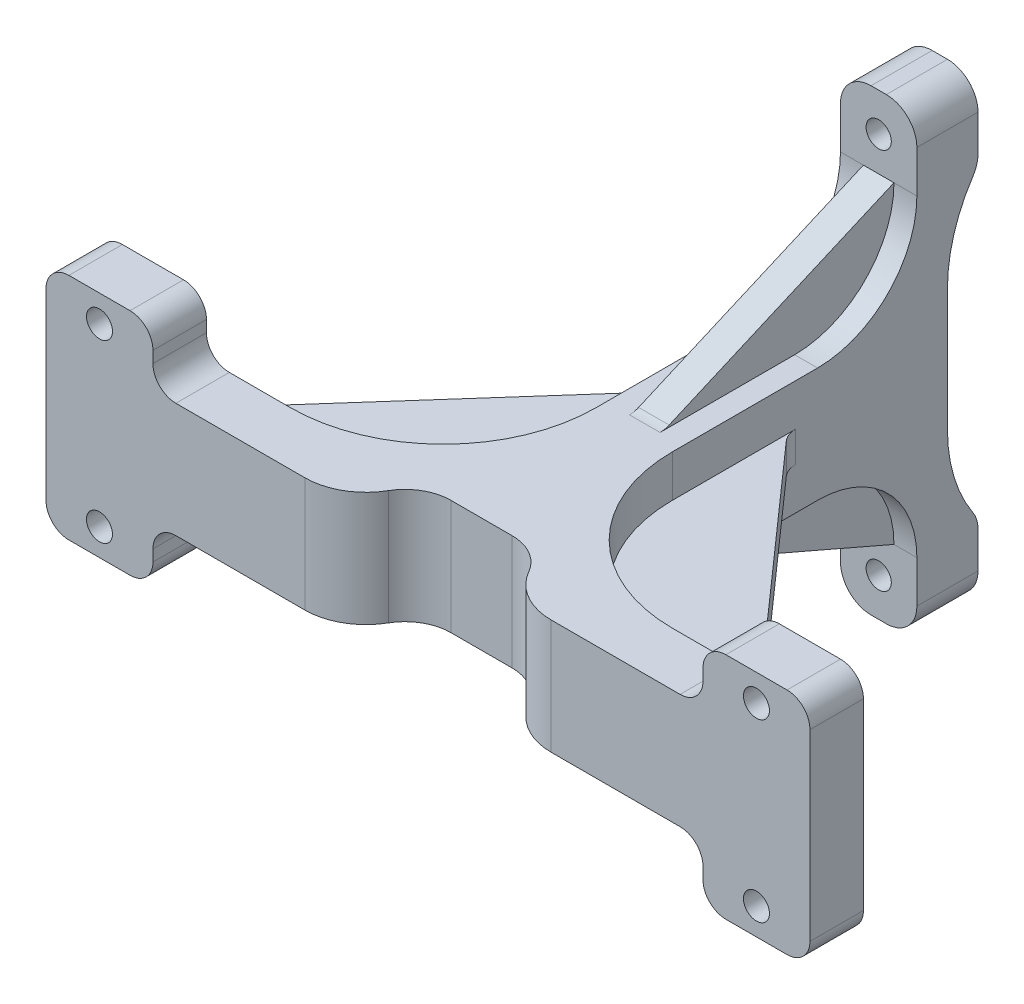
ISO-10303-21;
HEADER;
FILE_DESCRIPTION(('STEP AP214'),'2;1');
FILE_NAME('part.step','',(''),(''),'','','');
FILE_SCHEMA(('AUTOMOTIVE_DESIGN { 1 0 10303 214 1 1 1 1 }'));
ENDSEC;
DATA;
#1=APPLICATION_CONTEXT('core data for automotive mechanical design processes');
#2=APPLICATION_PROTOCOL_DEFINITION('international standard','automotive_design',2000,#1);
#3=PRODUCT_CONTEXT('',#1,'mechanical');
#4=PRODUCT('Part','Part','',(#3));
#5=PRODUCT_RELATED_PRODUCT_CATEGORY('part','',(#4));
#6=PRODUCT_DEFINITION_FORMATION('','',#4);
#7=PRODUCT_DEFINITION_CONTEXT('part definition',#1,'design');
#8=PRODUCT_DEFINITION('design','',#6,#7);
#9=PRODUCT_DEFINITION_SHAPE('','',#8);
#10=(LENGTH_UNIT() NAMED_UNIT(*) SI_UNIT(.MILLI.,.METRE.));
#11=(NAMED_UNIT(*) PLANE_ANGLE_UNIT() SI_UNIT($,.RADIAN.));
#12=(NAMED_UNIT(*) SI_UNIT($,.STERADIAN.) SOLID_ANGLE_UNIT());
#13=UNCERTAINTY_MEASURE_WITH_UNIT(LENGTH_MEASURE(1.E-05),#10,'distance_accuracy_value','');
#14=(GEOMETRIC_REPRESENTATION_CONTEXT(3) GLOBAL_UNCERTAINTY_ASSIGNED_CONTEXT((#13)) GLOBAL_UNIT_ASSIGNED_CONTEXT((#10,
#11,#12)) REPRESENTATION_CONTEXT('',''));
#15=CARTESIAN_POINT('',(0.,0.,0.));
#16=DIRECTION('',(0.,0.,1.));
#17=DIRECTION('',(1.,0.,0.));
#18=AXIS2_PLACEMENT_3D('',#15,#16,#17);
#19=CARTESIAN_POINT('',(-50.,20.5,21.));
#20=DIRECTION('',(1.,0.,0.));
#21=DIRECTION('',(0.,0.,-1.));
#22=AXIS2_PLACEMENT_3D('',#19,#20,#21);
#23=CYLINDRICAL_SURFACE('',#22,13.);
#24=CARTESIAN_POINT('',(-2.,20.5,21.));
#25=DIRECTION('',(1.,0.,0.));
#26=DIRECTION('',(0.,0.,-1.));
#27=AXIS2_PLACEMENT_3D('',#24,#25,#26);
#28=CIRCLE('',#27,13.);
#29=CARTESIAN_POINT('',(-2.,20.5,8.));
#30=VERTEX_POINT('',#29);
#31=CARTESIAN_POINT('',(-2.,7.5,21.));
#32=VERTEX_POINT('',#31);
#33=EDGE_CURVE('E501',#30,#32,#28,.F.);
#34=ORIENTED_EDGE('',*,*,#33,.F.);
#35=DIRECTION('',(-1.,0.,0.));
#36=VECTOR('',#35,1.);
#37=CARTESIAN_POINT('',(5.,20.5,8.));
#38=LINE('',#37,#36);
#39=CARTESIAN_POINT('',(-5.,20.5,8.));
#40=VERTEX_POINT('',#39);
#41=EDGE_CURVE('E834',#40,#30,#38,.F.);
#42=ORIENTED_EDGE('',*,*,#41,.F.);
#43=CARTESIAN_POINT('',(-5.,20.5,21.));
#44=DIRECTION('',(1.,0.,0.));
#45=DIRECTION('',(0.,0.,-1.));
#46=AXIS2_PLACEMENT_3D('',#43,#44,#45);
#47=CIRCLE('',#46,13.);
#48=CARTESIAN_POINT('',(-5.,7.5,21.));
#49=VERTEX_POINT('',#48);
#50=EDGE_CURVE('E504',#49,#40,#47,.T.);
#51=ORIENTED_EDGE('',*,*,#50,.F.);
#52=DIRECTION('',(-1.,0.,0.));
#53=VECTOR('',#52,1.);
#54=CARTESIAN_POINT('',(-5.,7.5,21.));
#55=LINE('',#54,#53);
#56=EDGE_CURVE('E497',#32,#49,#55,.T.);
#57=ORIENTED_EDGE('',*,*,#56,.F.);
#58=EDGE_LOOP('',(#34,#42,#51,#57));
#59=FACE_BOUND('',#58,.T.);
#60=ADVANCED_FACE('F46',(#59),#23,.F.);
#61=CARTESIAN_POINT('',(61.6590681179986,-20.5,21.));
#62=DIRECTION('',(1.,0.,0.));
#63=DIRECTION('',(0.,0.,-1.));
#64=AXIS2_PLACEMENT_3D('',#61,#62,#63);
#65=CYLINDRICAL_SURFACE('',#64,13.);
#66=CARTESIAN_POINT('',(-2.,-20.5,21.));
#67=DIRECTION('',(1.,0.,0.));
#68=DIRECTION('',(0.,0.,-1.));
#69=AXIS2_PLACEMENT_3D('',#66,#67,#68);
#70=CIRCLE('',#69,13.);
#71=CARTESIAN_POINT('',(-2.,-7.5,21.));
#72=VERTEX_POINT('',#71);
#73=CARTESIAN_POINT('',(-2.,-20.5,8.));
#74=VERTEX_POINT('',#73);
#75=EDGE_CURVE('E546',#72,#74,#70,.F.);
#76=ORIENTED_EDGE('',*,*,#75,.F.);
#77=DIRECTION('',(-1.,0.,0.));
#78=VECTOR('',#77,1.);
#79=CARTESIAN_POINT('',(5.,-7.5,21.));
#80=LINE('',#79,#78);
#81=CARTESIAN_POINT('',(-5.,-7.5,21.));
#82=VERTEX_POINT('',#81);
#83=EDGE_CURVE('E843',#82,#72,#80,.F.);
#84=ORIENTED_EDGE('',*,*,#83,.F.);
#85=CARTESIAN_POINT('',(-5.,-20.5,21.));
#86=DIRECTION('',(1.,0.,0.));
#87=DIRECTION('',(0.,0.,-1.));
#88=AXIS2_PLACEMENT_3D('',#85,#86,#87);
#89=CIRCLE('',#88,13.);
#90=CARTESIAN_POINT('',(-5.,-20.5,8.));
#91=VERTEX_POINT('',#90);
#92=EDGE_CURVE('E853',#91,#82,#89,.T.);
#93=ORIENTED_EDGE('',*,*,#92,.F.);
#94=DIRECTION('',(-1.,0.,0.));
#95=VECTOR('',#94,1.);
#96=CARTESIAN_POINT('',(-5.,-20.5,8.));
#97=LINE('',#96,#95);
#98=EDGE_CURVE('E837',#74,#91,#97,.T.);
#99=ORIENTED_EDGE('',*,*,#98,.F.);
#100=EDGE_LOOP('',(#76,#84,#93,#99));
#101=FACE_BOUND('',#100,.T.);
#102=ADVANCED_FACE('F1507',(#101),#65,.F.);
#103=CARTESIAN_POINT('',(25.,0.,40.));
#104=DIRECTION('',(0.,1.,0.));
#105=DIRECTION('',(0.,0.,1.));
#106=AXIS2_PLACEMENT_3D('',#103,#104,#105);
#107=CYLINDRICAL_SURFACE('',#106,20.);
#108=CARTESIAN_POINT('',(25.,-2.,40.));
#109=DIRECTION('',(0.,1.,0.));
#110=DIRECTION('',(0.,0.,1.));
#111=AXIS2_PLACEMENT_3D('',#108,#109,#110);
#112=CIRCLE('',#111,20.);
#113=CARTESIAN_POINT('',(25.,-2.,60.));
#114=VERTEX_POINT('',#113);
#115=CARTESIAN_POINT('',(5.,-2.,40.));
#116=VERTEX_POINT('',#115);
#117=EDGE_CURVE('E572',#114,#116,#112,.F.);
#118=ORIENTED_EDGE('',*,*,#117,.F.);
#119=DIRECTION('',(0.,1.,0.));
#120=VECTOR('',#119,1.);
#121=CARTESIAN_POINT('',(25.,0.,60.));
#122=LINE('',#121,#120);
#123=CARTESIAN_POINT('',(25.,-7.5,60.));
#124=VERTEX_POINT('',#123);
#125=EDGE_CURVE('E882',#124,#114,#122,.T.);
#126=ORIENTED_EDGE('',*,*,#125,.F.);
#127=CARTESIAN_POINT('',(25.,-7.5,40.));
#128=DIRECTION('',(0.,1.,0.));
#129=DIRECTION('',(0.,0.,1.));
#130=AXIS2_PLACEMENT_3D('',#127,#128,#129);
#131=CIRCLE('',#130,20.);
#132=CARTESIAN_POINT('',(5.,-7.5,40.));
#133=VERTEX_POINT('',#132);
#134=EDGE_CURVE('E903',#133,#124,#131,.T.);
#135=ORIENTED_EDGE('',*,*,#134,.F.);
#136=DIRECTION('',(0.,1.,0.));
#137=VECTOR('',#136,1.);
#138=CARTESIAN_POINT('',(5.,-30.,40.));
#139=LINE('',#138,#137);
#140=EDGE_CURVE('E886',#116,#133,#139,.F.);
#141=ORIENTED_EDGE('',*,*,#140,.F.);
#142=EDGE_LOOP('',(#118,#126,#135,#141));
#143=FACE_BOUND('',#142,.T.);
#144=ADVANCED_FACE('F1512',(#143),#107,.F.);
#145=CARTESIAN_POINT('',(-25.,0.,40.));
#146=DIRECTION('',(0.,-1.,0.));
#147=DIRECTION('',(0.,0.,-1.));
#148=AXIS2_PLACEMENT_3D('',#145,#146,#147);
#149=CYLINDRICAL_SURFACE('',#148,20.);
#150=CARTESIAN_POINT('',(-25.,-2.,40.));
#151=DIRECTION('',(0.,1.,0.));
#152=DIRECTION('',(0.,0.,1.));
#153=AXIS2_PLACEMENT_3D('',#150,#151,#152);
#154=CIRCLE('',#153,20.);
#155=CARTESIAN_POINT('',(-5.,-2.,40.));
#156=VERTEX_POINT('',#155);
#157=CARTESIAN_POINT('',(-25.,-2.,60.));
#158=VERTEX_POINT('',#157);
#159=EDGE_CURVE('E599',#156,#158,#154,.F.);
#160=ORIENTED_EDGE('',*,*,#159,.F.);
#161=DIRECTION('',(0.,-1.,0.));
#162=VECTOR('',#161,1.);
#163=CARTESIAN_POINT('',(-5.,-30.,40.));
#164=LINE('',#163,#162);
#165=CARTESIAN_POINT('',(-5.,-7.5,40.));
#166=VERTEX_POINT('',#165);
#167=EDGE_CURVE('E897',#166,#156,#164,.F.);
#168=ORIENTED_EDGE('',*,*,#167,.F.);
#169=CARTESIAN_POINT('',(-25.,-7.5,40.));
#170=DIRECTION('',(0.,1.,0.));
#171=DIRECTION('',(0.,0.,1.));
#172=AXIS2_PLACEMENT_3D('',#169,#170,#171);
#173=CIRCLE('',#172,20.);
#174=CARTESIAN_POINT('',(-25.,-7.5,60.));
#175=VERTEX_POINT('',#174);
#176=EDGE_CURVE('E906',#175,#166,#173,.T.);
#177=ORIENTED_EDGE('',*,*,#176,.F.);
#178=DIRECTION('',(0.,-1.,0.));
#179=VECTOR('',#178,1.);
#180=CARTESIAN_POINT('',(-25.,0.,60.));
#181=LINE('',#180,#179);
#182=EDGE_CURVE('E891',#158,#175,#181,.T.);
#183=ORIENTED_EDGE('',*,*,#182,.F.);
#184=EDGE_LOOP('',(#160,#168,#177,#183));
#185=FACE_BOUND('',#184,.T.);
#186=ADVANCED_FACE('F1552',(#185),#149,.F.);
#187=CARTESIAN_POINT('',(-50.,7.5,67.));
#188=DIRECTION('',(0.,-1.,0.));
#189=DIRECTION('',(0.,0.,-1.));
#190=AXIS2_PLACEMENT_3D('',#187,#188,#189);
#191=PLANE('',#190);
#192=DIRECTION('',(-1.,0.,0.));
#193=VECTOR('',#192,1.);
#194=CARTESIAN_POINT('',(-50.,7.5,60.));
#195=LINE('',#194,#193);
#196=CARTESIAN_POINT('',(-25.,7.5,60.));
#197=VERTEX_POINT('',#196);
#198=CARTESIAN_POINT('',(-33.,7.5,60.));
#199=VERTEX_POINT('',#198);
#200=EDGE_CURVE('E804',#197,#199,#195,.T.);
#201=ORIENTED_EDGE('',*,*,#200,.T.);
#202=DIRECTION('',(0.,0.,-1.));
#203=VECTOR('',#202,1.);
#204=CARTESIAN_POINT('',(-33.,7.5,67.));
#205=LINE('',#204,#203);
#206=CARTESIAN_POINT('',(-33.,7.5,67.));
#207=VERTEX_POINT('',#206);
#208=EDGE_CURVE('E1049',#199,#207,#205,.F.);
#209=ORIENTED_EDGE('',*,*,#208,.T.);
#210=DIRECTION('',(-1.,0.,0.));
#211=VECTOR('',#210,1.);
#212=CARTESIAN_POINT('',(-50.,7.5,67.));
#213=LINE('',#212,#211);
#214=CARTESIAN_POINT('',(-16.1243556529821,7.5,67.));
#215=VERTEX_POINT('',#214);
#216=EDGE_CURVE('E787',#215,#207,#213,.T.);
#217=ORIENTED_EDGE('',*,*,#216,.F.);
#218=CARTESIAN_POINT('',(-16.1243556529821,7.5,59.));
#219=DIRECTION('',(0.,-1.,0.));
#220=DIRECTION('',(0.,0.,-1.));
#221=AXIS2_PLACEMENT_3D('',#218,#219,#220);
#222=CIRCLE('',#221,8.);
#223=CARTESIAN_POINT('',(-9.19615242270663,7.5,63.));
#224=VERTEX_POINT('',#223);
#225=EDGE_CURVE('E1027',#215,#224,#222,.F.);
#226=ORIENTED_EDGE('',*,*,#225,.T.);
#227=CARTESIAN_POINT('',(-4.,7.5,66.));
#228=DIRECTION('',(0.,-1.,0.));
#229=DIRECTION('',(0.,0.,-1.));
#230=AXIS2_PLACEMENT_3D('',#227,#228,#229);
#231=CIRCLE('',#230,6.);
#232=CARTESIAN_POINT('',(-4.,7.5,60.));
#233=VERTEX_POINT('',#232);
#234=EDGE_CURVE('E1006',#224,#233,#231,.T.);
#235=ORIENTED_EDGE('',*,*,#234,.T.);
#236=DIRECTION('',(-1.,0.,0.));
#237=VECTOR('',#236,1.);
#238=CARTESIAN_POINT('',(-10.,7.5,60.));
#239=LINE('',#238,#237);
#240=CARTESIAN_POINT('',(4.,7.5,60.));
#241=VERTEX_POINT('',#240);
#242=EDGE_CURVE('E711',#241,#233,#239,.T.);
#243=ORIENTED_EDGE('',*,*,#242,.F.);
#244=CARTESIAN_POINT('',(4.,7.5,66.));
#245=DIRECTION('',(0.,-1.,0.));
#246=DIRECTION('',(0.,0.,-1.));
#247=AXIS2_PLACEMENT_3D('',#244,#245,#246);
#248=CIRCLE('',#247,6.);
#249=CARTESIAN_POINT('',(9.19615242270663,7.5,63.));
#250=VERTEX_POINT('',#249);
#251=EDGE_CURVE('E994',#241,#250,#248,.T.);
#252=ORIENTED_EDGE('',*,*,#251,.T.);
#253=CARTESIAN_POINT('',(16.1243556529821,7.5,59.));
#254=DIRECTION('',(0.,-1.,0.));
#255=DIRECTION('',(0.,0.,-1.));
#256=AXIS2_PLACEMENT_3D('',#253,#254,#255);
#257=CIRCLE('',#256,8.);
#258=CARTESIAN_POINT('',(16.1243556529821,7.5,67.));
#259=VERTEX_POINT('',#258);
#260=EDGE_CURVE('E1023',#250,#259,#257,.F.);
#261=ORIENTED_EDGE('',*,*,#260,.T.);
#262=CARTESIAN_POINT('',(33.,7.5,67.));
#263=VERTEX_POINT('',#262);
#264=EDGE_CURVE('E789',#263,#259,#213,.T.);
#265=ORIENTED_EDGE('',*,*,#264,.F.);
#266=DIRECTION('',(0.,0.,-1.));
#267=VECTOR('',#266,1.);
#268=CARTESIAN_POINT('',(33.,7.5,67.));
#269=LINE('',#268,#267);
#270=CARTESIAN_POINT('',(33.,7.5,60.));
#271=VERTEX_POINT('',#270);
#272=EDGE_CURVE('E1045',#263,#271,#269,.T.);
#273=ORIENTED_EDGE('',*,*,#272,.T.);
#274=CARTESIAN_POINT('',(25.,7.5,60.));
#275=VERTEX_POINT('',#274);
#276=EDGE_CURVE('E805',#271,#275,#195,.T.);
#277=ORIENTED_EDGE('',*,*,#276,.T.);
#278=CARTESIAN_POINT('',(25.,7.5,40.));
#279=DIRECTION('',(0.,-1.,0.));
#280=DIRECTION('',(0.,0.,-1.));
#281=AXIS2_PLACEMENT_3D('',#278,#279,#280);
#282=CIRCLE('',#281,20.);
#283=CARTESIAN_POINT('',(5.,7.5,40.));
#284=VERTEX_POINT('',#283);
#285=EDGE_CURVE('E900',#275,#284,#282,.T.);
#286=ORIENTED_EDGE('',*,*,#285,.T.);
#287=DIRECTION('',(0.,0.,-1.));
#288=VECTOR('',#287,1.);
#289=CARTESIAN_POINT('',(5.,7.5,60.));
#290=LINE('',#289,#288);
#291=CARTESIAN_POINT('',(5.,7.5,21.));
#292=VERTEX_POINT('',#291);
#293=EDGE_CURVE('E752',#284,#292,#290,.T.);
#294=ORIENTED_EDGE('',*,*,#293,.T.);
#295=CARTESIAN_POINT('',(2.,7.5,21.));
#296=VERTEX_POINT('',#295);
#297=EDGE_CURVE('E509',#292,#296,#55,.T.);
#298=ORIENTED_EDGE('',*,*,#297,.T.);
#299=DIRECTION('',(0.,0.,1.));
#300=VECTOR('',#299,1.);
#301=CARTESIAN_POINT('',(2.,7.5,67.));
#302=LINE('',#301,#300);
#303=CARTESIAN_POINT('',(2.,7.5,38.6220535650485));
#304=VERTEX_POINT('',#303);
#305=EDGE_CURVE('E535',#296,#304,#302,.T.);
#306=ORIENTED_EDGE('',*,*,#305,.T.);
#307=DIRECTION('',(1.,0.,0.));
#308=VECTOR('',#307,1.);
#309=CARTESIAN_POINT('',(-50.,7.5,38.6220535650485));
#310=LINE('',#309,#308);
#311=CARTESIAN_POINT('',(-2.,7.5,38.6220535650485));
#312=VERTEX_POINT('',#311);
#313=EDGE_CURVE('E517',#304,#312,#310,.F.);
#314=ORIENTED_EDGE('',*,*,#313,.T.);
#315=DIRECTION('',(0.,0.,1.));
#316=VECTOR('',#315,1.);
#317=CARTESIAN_POINT('',(-2.,7.5,67.));
#318=LINE('',#317,#316);
#319=EDGE_CURVE('E513',#32,#312,#318,.T.);
#320=ORIENTED_EDGE('',*,*,#319,.F.);
#321=ORIENTED_EDGE('',*,*,#56,.T.);
#322=DIRECTION('',(0.,0.,1.));
#323=VECTOR('',#322,1.);
#324=CARTESIAN_POINT('',(-5.,7.5,60.));
#325=LINE('',#324,#323);
#326=CARTESIAN_POINT('',(-5.,7.5,40.));
#327=VERTEX_POINT('',#326);
#328=EDGE_CURVE('E760',#49,#327,#325,.T.);
#329=ORIENTED_EDGE('',*,*,#328,.T.);
#330=CARTESIAN_POINT('',(-25.,7.5,40.));
#331=DIRECTION('',(0.,-1.,0.));
#332=DIRECTION('',(0.,0.,-1.));
#333=AXIS2_PLACEMENT_3D('',#330,#331,#332);
#334=CIRCLE('',#333,20.);
#335=EDGE_CURVE('E909',#327,#197,#334,.T.);
#336=ORIENTED_EDGE('',*,*,#335,.T.);
#337=EDGE_LOOP('',(#201,#209,#217,#226,#235,#243,#252,#261,#265,#273,#277,#286,#294,#298,#306,
#314,#320,#321,#329,#336));
#338=FACE_BOUND('',#337,.T.);
#339=ADVANCED_FACE('F515',(#338),#191,.F.);
#340=CARTESIAN_POINT('',(-50.,-7.5,67.));
#341=DIRECTION('',(0.,1.,0.));
#342=DIRECTION('',(0.,0.,1.));
#343=AXIS2_PLACEMENT_3D('',#340,#341,#342);
#344=PLANE('',#343);
#345=DIRECTION('',(1.,0.,0.));
#346=VECTOR('',#345,1.);
#347=CARTESIAN_POINT('',(-50.,-7.5,67.));
#348=LINE('',#347,#346);
#349=CARTESIAN_POINT('',(-33.,-7.5,67.));
#350=VERTEX_POINT('',#349);
#351=CARTESIAN_POINT('',(-16.1243556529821,-7.5,67.));
#352=VERTEX_POINT('',#351);
#353=EDGE_CURVE('E797',#350,#352,#348,.T.);
#354=ORIENTED_EDGE('',*,*,#353,.F.);
#355=DIRECTION('',(0.,0.,-1.));
#356=VECTOR('',#355,1.);
#357=CARTESIAN_POINT('',(-33.,-7.5,67.));
#358=LINE('',#357,#356);
#359=CARTESIAN_POINT('',(-33.,-7.5,60.));
#360=VERTEX_POINT('',#359);
#361=EDGE_CURVE('E1115',#350,#360,#358,.T.);
#362=ORIENTED_EDGE('',*,*,#361,.T.);
#363=DIRECTION('',(1.,0.,0.));
#364=VECTOR('',#363,1.);
#365=CARTESIAN_POINT('',(-50.,-7.5,60.));
#366=LINE('',#365,#364);
#367=EDGE_CURVE('E788',#360,#175,#366,.T.);
#368=ORIENTED_EDGE('',*,*,#367,.T.);
#369=ORIENTED_EDGE('',*,*,#176,.T.);
#370=DIRECTION('',(0.,0.,-1.));
#371=VECTOR('',#370,1.);
#372=CARTESIAN_POINT('',(-5.,-7.5,60.));
#373=LINE('',#372,#371);
#374=EDGE_CURVE('E761',#166,#82,#373,.T.);
#375=ORIENTED_EDGE('',*,*,#374,.T.);
#376=ORIENTED_EDGE('',*,*,#83,.T.);
#377=DIRECTION('',(0.,0.,-1.));
#378=VECTOR('',#377,1.);
#379=CARTESIAN_POINT('',(-2.,-7.5,67.));
#380=LINE('',#379,#378);
#381=CARTESIAN_POINT('',(-2.,-7.5,38.6220535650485));
#382=VERTEX_POINT('',#381);
#383=EDGE_CURVE('E552',#382,#72,#380,.T.);
#384=ORIENTED_EDGE('',*,*,#383,.F.);
#385=DIRECTION('',(1.,0.,0.));
#386=VECTOR('',#385,1.);
#387=CARTESIAN_POINT('',(-50.,-7.5,38.6220535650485));
#388=LINE('',#387,#386);
#389=CARTESIAN_POINT('',(2.,-7.5,38.6220535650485));
#390=VERTEX_POINT('',#389);
#391=EDGE_CURVE('E1108',#382,#390,#388,.T.);
#392=ORIENTED_EDGE('',*,*,#391,.T.);
#393=DIRECTION('',(0.,0.,-1.));
#394=VECTOR('',#393,1.);
#395=CARTESIAN_POINT('',(2.,-7.5,67.));
#396=LINE('',#395,#394);
#397=CARTESIAN_POINT('',(2.,-7.5,21.));
#398=VERTEX_POINT('',#397);
#399=EDGE_CURVE('E560',#390,#398,#396,.T.);
#400=ORIENTED_EDGE('',*,*,#399,.T.);
#401=CARTESIAN_POINT('',(5.,-7.5,21.));
#402=VERTEX_POINT('',#401);
#403=EDGE_CURVE('E842',#398,#402,#80,.F.);
#404=ORIENTED_EDGE('',*,*,#403,.T.);
#405=DIRECTION('',(0.,0.,1.));
#406=VECTOR('',#405,1.);
#407=CARTESIAN_POINT('',(5.,-7.5,60.));
#408=LINE('',#407,#406);
#409=EDGE_CURVE('E772',#402,#133,#408,.T.);
#410=ORIENTED_EDGE('',*,*,#409,.T.);
#411=ORIENTED_EDGE('',*,*,#134,.T.);
#412=CARTESIAN_POINT('',(33.,-7.5,60.));
#413=VERTEX_POINT('',#412);
#414=EDGE_CURVE('E812',#124,#413,#366,.T.);
#415=ORIENTED_EDGE('',*,*,#414,.T.);
#416=DIRECTION('',(0.,0.,-1.));
#417=VECTOR('',#416,1.);
#418=CARTESIAN_POINT('',(33.,-7.5,67.));
#419=LINE('',#418,#417);
#420=CARTESIAN_POINT('',(33.,-7.5,67.));
#421=VERTEX_POINT('',#420);
#422=EDGE_CURVE('E1112',#413,#421,#419,.F.);
#423=ORIENTED_EDGE('',*,*,#422,.T.);
#424=CARTESIAN_POINT('',(16.1243556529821,-7.5,67.));
#425=VERTEX_POINT('',#424);
#426=EDGE_CURVE('E796',#425,#421,#348,.T.);
#427=ORIENTED_EDGE('',*,*,#426,.F.);
#428=CARTESIAN_POINT('',(16.1243556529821,-7.5,59.));
#429=DIRECTION('',(0.,1.,0.));
#430=DIRECTION('',(0.,0.,1.));
#431=AXIS2_PLACEMENT_3D('',#428,#429,#430);
#432=CIRCLE('',#431,8.);
#433=CARTESIAN_POINT('',(9.19615242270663,-7.5,63.));
#434=VERTEX_POINT('',#433);
#435=EDGE_CURVE('E1013',#425,#434,#432,.F.);
#436=ORIENTED_EDGE('',*,*,#435,.T.);
#437=CARTESIAN_POINT('',(4.,-7.5,66.));
#438=DIRECTION('',(0.,1.,0.));
#439=DIRECTION('',(0.,0.,1.));
#440=AXIS2_PLACEMENT_3D('',#437,#438,#439);
#441=CIRCLE('',#440,6.);
#442=CARTESIAN_POINT('',(4.,-7.5,60.));
#443=VERTEX_POINT('',#442);
#444=EDGE_CURVE('E998',#434,#443,#441,.T.);
#445=ORIENTED_EDGE('',*,*,#444,.T.);
#446=DIRECTION('',(1.,0.,0.));
#447=VECTOR('',#446,1.);
#448=CARTESIAN_POINT('',(-10.,-7.5,60.));
#449=LINE('',#448,#447);
#450=CARTESIAN_POINT('',(-4.,-7.5,60.));
#451=VERTEX_POINT('',#450);
#452=EDGE_CURVE('E720',#451,#443,#449,.T.);
#453=ORIENTED_EDGE('',*,*,#452,.F.);
#454=CARTESIAN_POINT('',(-4.,-7.5,66.));
#455=DIRECTION('',(0.,1.,0.));
#456=DIRECTION('',(0.,0.,1.));
#457=AXIS2_PLACEMENT_3D('',#454,#455,#456);
#458=CIRCLE('',#457,6.);
#459=CARTESIAN_POINT('',(-9.19615242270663,-7.5,63.));
#460=VERTEX_POINT('',#459);
#461=EDGE_CURVE('E1002',#451,#460,#458,.T.);
#462=ORIENTED_EDGE('',*,*,#461,.T.);
#463=CARTESIAN_POINT('',(-16.1243556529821,-7.5,59.));
#464=DIRECTION('',(0.,1.,0.));
#465=DIRECTION('',(0.,0.,1.));
#466=AXIS2_PLACEMENT_3D('',#463,#464,#465);
#467=CIRCLE('',#466,8.);
#468=EDGE_CURVE('E1016',#460,#352,#467,.F.);
#469=ORIENTED_EDGE('',*,*,#468,.T.);
#470=EDGE_LOOP('',(#354,#362,#368,#369,#375,#376,#384,#392,#400,#404,#410,#411,#415,#423,#427,
#436,#445,#453,#462,#469));
#471=FACE_BOUND('',#470,.T.);
#472=ADVANCED_FACE('F1369',(#471),#344,.F.);
#473=CARTESIAN_POINT('',(0.,0.,67.));
#474=DIRECTION('',(0.,0.,-1.));
#475=DIRECTION('',(-1.,0.,0.));
#476=AXIS2_PLACEMENT_3D('',#473,#474,#475);
#477=PLANE('',#476);
#478=CARTESIAN_POINT('',(43.,11.5,67.));
#479=DIRECTION('',(0.,0.,1.));
#480=DIRECTION('',(1.,0.,0.));
#481=AXIS2_PLACEMENT_3D('',#478,#479,#480);
#482=CIRCLE('',#481,1.7);
#483=CARTESIAN_POINT('',(44.7,11.5,67.));
#484=VERTEX_POINT('',#483);
#485=EDGE_CURVE('E643',#484,#484,#482,.T.);
#486=ORIENTED_EDGE('',*,*,#485,.F.);
#487=EDGE_LOOP('',(#486));
#488=FACE_BOUND('',#487,.T.);
#489=DIRECTION('',(-1.,0.,0.));
#490=VECTOR('',#489,1.);
#491=CARTESIAN_POINT('',(50.,-15.,67.));
#492=LINE('',#491,#490);
#493=CARTESIAN_POINT('',(47.,-15.,67.));
#494=VERTEX_POINT('',#493);
#495=CARTESIAN_POINT('',(39.,-15.,67.));
#496=VERTEX_POINT('',#495);
#497=EDGE_CURVE('E691',#494,#496,#492,.T.);
#498=ORIENTED_EDGE('',*,*,#497,.F.);
#499=CARTESIAN_POINT('',(47.,-12.,67.));
#500=DIRECTION('',(0.,0.,-1.));
#501=DIRECTION('',(-1.,0.,0.));
#502=AXIS2_PLACEMENT_3D('',#499,#500,#501);
#503=CIRCLE('',#502,3.);
#504=CARTESIAN_POINT('',(50.,-12.,67.));
#505=VERTEX_POINT('',#504);
#506=EDGE_CURVE('E1158',#494,#505,#503,.F.);
#507=ORIENTED_EDGE('',*,*,#506,.T.);
#508=DIRECTION('',(0.,1.,0.));
#509=VECTOR('',#508,1.);
#510=CARTESIAN_POINT('',(50.,-7.5,67.));
#511=LINE('',#510,#509);
#512=CARTESIAN_POINT('',(50.,12.,67.));
#513=VERTEX_POINT('',#512);
#514=EDGE_CURVE('E783',#505,#513,#511,.T.);
#515=ORIENTED_EDGE('',*,*,#514,.T.);
#516=CARTESIAN_POINT('',(47.,12.,67.));
#517=DIRECTION('',(0.,0.,-1.));
#518=DIRECTION('',(-1.,0.,0.));
#519=AXIS2_PLACEMENT_3D('',#516,#517,#518);
#520=CIRCLE('',#519,3.);
#521=CARTESIAN_POINT('',(47.,15.,67.));
#522=VERTEX_POINT('',#521);
#523=EDGE_CURVE('E1155',#513,#522,#520,.F.);
#524=ORIENTED_EDGE('',*,*,#523,.T.);
#525=DIRECTION('',(-1.,0.,0.));
#526=VECTOR('',#525,1.);
#527=CARTESIAN_POINT('',(50.,15.,67.));
#528=LINE('',#527,#526);
#529=CARTESIAN_POINT('',(39.,15.,67.));
#530=VERTEX_POINT('',#529);
#531=EDGE_CURVE('E706',#522,#530,#528,.T.);
#532=ORIENTED_EDGE('',*,*,#531,.T.);
#533=CARTESIAN_POINT('',(39.,12.,67.));
#534=DIRECTION('',(0.,0.,-1.));
#535=DIRECTION('',(-1.,0.,0.));
#536=AXIS2_PLACEMENT_3D('',#533,#534,#535);
#537=CIRCLE('',#536,3.);
#538=CARTESIAN_POINT('',(36.,12.,67.));
#539=VERTEX_POINT('',#538);
#540=EDGE_CURVE('E1152',#530,#539,#537,.F.);
#541=ORIENTED_EDGE('',*,*,#540,.T.);
#542=DIRECTION('',(0.,-1.,0.));
#543=VECTOR('',#542,1.);
#544=CARTESIAN_POINT('',(36.,7.5,67.));
#545=LINE('',#544,#543);
#546=CARTESIAN_POINT('',(36.,10.5,67.));
#547=VERTEX_POINT('',#546);
#548=EDGE_CURVE('E702',#539,#547,#545,.T.);
#549=ORIENTED_EDGE('',*,*,#548,.T.);
#550=CARTESIAN_POINT('',(33.,10.5,67.));
#551=DIRECTION('',(0.,0.,-1.));
#552=DIRECTION('',(-1.,0.,0.));
#553=AXIS2_PLACEMENT_3D('',#550,#551,#552);
#554=CIRCLE('',#553,3.);
#555=EDGE_CURVE('E1224',#547,#263,#554,.T.);
#556=ORIENTED_EDGE('',*,*,#555,.T.);
#557=ORIENTED_EDGE('',*,*,#264,.T.);
#558=DIRECTION('',(0.,-1.,0.));
#559=VECTOR('',#558,1.);
#560=CARTESIAN_POINT('',(16.1243556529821,0.,67.));
#561=LINE('',#560,#559);
#562=EDGE_CURVE('E1033',#259,#425,#561,.T.);
#563=ORIENTED_EDGE('',*,*,#562,.T.);
#564=ORIENTED_EDGE('',*,*,#426,.T.);
#565=CARTESIAN_POINT('',(33.,-10.5,67.));
#566=DIRECTION('',(0.,0.,-1.));
#567=DIRECTION('',(-1.,0.,0.));
#568=AXIS2_PLACEMENT_3D('',#565,#566,#567);
#569=CIRCLE('',#568,3.);
#570=CARTESIAN_POINT('',(36.,-10.5,67.));
#571=VERTEX_POINT('',#570);
#572=EDGE_CURVE('E1230',#421,#571,#569,.T.);
#573=ORIENTED_EDGE('',*,*,#572,.T.);
#574=DIRECTION('',(0.,1.,0.));
#575=VECTOR('',#574,1.);
#576=CARTESIAN_POINT('',(36.,-7.5,67.));
#577=LINE('',#576,#575);
#578=CARTESIAN_POINT('',(36.,-12.,67.));
#579=VERTEX_POINT('',#578);
#580=EDGE_CURVE('E686',#579,#571,#577,.T.);
#581=ORIENTED_EDGE('',*,*,#580,.F.);
#582=CARTESIAN_POINT('',(39.,-12.,67.));
#583=DIRECTION('',(0.,0.,-1.));
#584=DIRECTION('',(-1.,0.,0.));
#585=AXIS2_PLACEMENT_3D('',#582,#583,#584);
#586=CIRCLE('',#585,3.);
#587=EDGE_CURVE('E1149',#579,#496,#586,.F.);
#588=ORIENTED_EDGE('',*,*,#587,.T.);
#589=EDGE_LOOP('',(#498,#507,#515,#524,#532,#541,#549,#556,#557,#563,#564,#573,#581,#588));
#590=FACE_BOUND('',#589,.T.);
#591=CARTESIAN_POINT('',(43.,-11.5,67.));
#592=DIRECTION('',(0.,0.,1.));
#593=DIRECTION('',(1.,0.,0.));
#594=AXIS2_PLACEMENT_3D('',#591,#592,#593);
#595=CIRCLE('',#594,1.7);
#596=CARTESIAN_POINT('',(44.7,-11.5,67.));
#597=VERTEX_POINT('',#596);
#598=EDGE_CURVE('E638',#597,#597,#595,.T.);
#599=ORIENTED_EDGE('',*,*,#598,.F.);
#600=EDGE_LOOP('',(#599));
#601=FACE_BOUND('',#600,.T.);
#602=ADVANCED_FACE('F1401',(#488,#590,#601),#477,.F.);
#603=CARTESIAN_POINT('',(0.,0.,0.));
#604=DIRECTION('',(0.,0.,-1.));
#605=DIRECTION('',(-1.,0.,0.));
#606=AXIS2_PLACEMENT_3D('',#603,#604,#605);
#607=PLANE('',#606);
#608=CARTESIAN_POINT('',(0.999999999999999,-26.,0.));
#609=DIRECTION('',(0.,0.,-1.));
#610=DIRECTION('',(-1.,0.,0.));
#611=AXIS2_PLACEMENT_3D('',#608,#609,#610);
#612=CIRCLE('',#611,4.);
#613=CARTESIAN_POINT('',(5.,-26.,0.));
#614=VERTEX_POINT('',#613);
#615=CARTESIAN_POINT('',(0.999999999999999,-30.,0.));
#616=VERTEX_POINT('',#615);
#617=EDGE_CURVE('E956',#614,#616,#612,.T.);
#618=ORIENTED_EDGE('',*,*,#617,.T.);
#619=DIRECTION('',(1.,0.,0.));
#620=VECTOR('',#619,1.);
#621=CARTESIAN_POINT('',(-5.,-30.,0.));
#622=LINE('',#621,#620);
#623=CARTESIAN_POINT('',(-1.,-30.,0.));
#624=VERTEX_POINT('',#623);
#625=EDGE_CURVE('E510',#624,#616,#622,.T.);
#626=ORIENTED_EDGE('',*,*,#625,.F.);
#627=CARTESIAN_POINT('',(-1.,-26.,0.));
#628=DIRECTION('',(0.,0.,-1.));
#629=DIRECTION('',(-1.,0.,0.));
#630=AXIS2_PLACEMENT_3D('',#627,#628,#629);
#631=CIRCLE('',#630,4.);
#632=CARTESIAN_POINT('',(-5.,-26.,0.));
#633=VERTEX_POINT('',#632);
#634=EDGE_CURVE('E953',#624,#633,#631,.T.);
#635=ORIENTED_EDGE('',*,*,#634,.T.);
#636=DIRECTION('',(0.,-1.,0.));
#637=VECTOR('',#636,1.);
#638=CARTESIAN_POINT('',(-5.,-30.,0.));
#639=LINE('',#638,#637);
#640=CARTESIAN_POINT('',(-5.,-21.2664991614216,0.));
#641=VERTEX_POINT('',#640);
#642=EDGE_CURVE('E823',#641,#633,#639,.T.);
#643=ORIENTED_EDGE('',*,*,#642,.F.);
#644=DIRECTION('',(-1.,0.,0.));
#645=VECTOR('',#644,1.);
#646=CARTESIAN_POINT('',(5.,-21.2664991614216,0.));
#647=LINE('',#646,#645);
#648=CARTESIAN_POINT('',(5.,-21.2664991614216,0.));
#649=VERTEX_POINT('',#648);
#650=EDGE_CURVE('E959',#641,#649,#647,.F.);
#651=ORIENTED_EDGE('',*,*,#650,.T.);
#652=DIRECTION('',(0.,1.,0.));
#653=VECTOR('',#652,1.);
#654=CARTESIAN_POINT('',(5.,-30.,0.));
#655=LINE('',#654,#653);
#656=EDGE_CURVE('E818',#614,#649,#655,.T.);
#657=ORIENTED_EDGE('',*,*,#656,.F.);
#658=EDGE_LOOP('',(#618,#626,#635,#643,#651,#657));
#659=FACE_BOUND('',#658,.T.);
#660=CARTESIAN_POINT('',(0.,-25.,0.));
#661=DIRECTION('',(0.,0.,-1.));
#662=DIRECTION('',(-1.,0.,0.));
#663=AXIS2_PLACEMENT_3D('',#660,#661,#662);
#664=CIRCLE('',#663,1.65);
#665=CARTESIAN_POINT('',(-1.65,-25.,0.));
#666=VERTEX_POINT('',#665);
#667=EDGE_CURVE('E737',#666,#666,#664,.T.);
#668=ORIENTED_EDGE('',*,*,#667,.F.);
#669=EDGE_LOOP('',(#668));
#670=FACE_BOUND('',#669,.T.);
#671=ADVANCED_FACE('F1557',(#659,#670),#607,.T.);
#672=CARTESIAN_POINT('',(5.,-30.,60.));
#673=DIRECTION('',(-1.,0.,0.));
#674=DIRECTION('',(0.,0.,1.));
#675=AXIS2_PLACEMENT_3D('',#672,#673,#674);
#676=PLANE('',#675);
#677=DIRECTION('',(0.,1.,0.));
#678=VECTOR('',#677,1.);
#679=CARTESIAN_POINT('',(5.,-30.,23.8624504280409));
#680=LINE('',#679,#678);
#681=CARTESIAN_POINT('',(5.,2.,23.8624504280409));
#682=VERTEX_POINT('',#681);
#683=CARTESIAN_POINT('',(5.,-2.,23.8624504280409));
#684=VERTEX_POINT('',#683);
#685=EDGE_CURVE('E1199',#682,#684,#680,.F.);
#686=ORIENTED_EDGE('',*,*,#685,.T.);
#687=DIRECTION('',(0.,0.,-1.));
#688=VECTOR('',#687,1.);
#689=CARTESIAN_POINT('',(5.,-2.,60.));
#690=LINE('',#689,#688);
#691=EDGE_CURVE('E582',#116,#684,#690,.T.);
#692=ORIENTED_EDGE('',*,*,#691,.F.);
#693=ORIENTED_EDGE('',*,*,#140,.T.);
#694=ORIENTED_EDGE('',*,*,#409,.F.);
#695=CARTESIAN_POINT('',(5.,-20.5,21.));
#696=DIRECTION('',(-1.,0.,0.));
#697=DIRECTION('',(0.,0.,1.));
#698=AXIS2_PLACEMENT_3D('',#695,#696,#697);
#699=CIRCLE('',#698,13.);
#700=CARTESIAN_POINT('',(5.,-20.5,8.));
#701=VERTEX_POINT('',#700);
#702=EDGE_CURVE('E857',#402,#701,#699,.T.);
#703=ORIENTED_EDGE('',*,*,#702,.T.);
#704=DIRECTION('',(0.,1.,0.));
#705=VECTOR('',#704,1.);
#706=CARTESIAN_POINT('',(5.,-30.,8.));
#707=LINE('',#706,#705);
#708=CARTESIAN_POINT('',(5.,-26.,8.));
#709=VERTEX_POINT('',#708);
#710=EDGE_CURVE('E741',#709,#701,#707,.T.);
#711=ORIENTED_EDGE('',*,*,#710,.F.);
#712=DIRECTION('',(0.,0.,-1.));
#713=VECTOR('',#712,1.);
#714=CARTESIAN_POINT('',(5.,-26.,60.));
#715=LINE('',#714,#713);
#716=EDGE_CURVE('E915',#709,#614,#715,.T.);
#717=ORIENTED_EDGE('',*,*,#716,.T.);
#718=ORIENTED_EDGE('',*,*,#656,.T.);
#719=CARTESIAN_POINT('',(5.,-21.2664991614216,4.));
#720=DIRECTION('',(-1.,0.,0.));
#721=DIRECTION('',(0.,0.,1.));
#722=AXIS2_PLACEMENT_3D('',#719,#720,#721);
#723=CIRCLE('',#722,4.);
#724=CARTESIAN_POINT('',(5.,-19.0554159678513,0.666666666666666));
#725=VERTEX_POINT('',#724);
#726=EDGE_CURVE('E922',#649,#725,#723,.F.);
#727=ORIENTED_EDGE('',*,*,#726,.T.);
#728=CARTESIAN_POINT('',(5.,-8.,-16.));
#729=DIRECTION('',(-1.,0.,0.));
#730=DIRECTION('',(0.,0.,1.));
#731=AXIS2_PLACEMENT_3D('',#728,#729,#730);
#732=CIRCLE('',#731,20.);
#733=CARTESIAN_POINT('',(5.,-8.,4.));
#734=VERTEX_POINT('',#733);
#735=EDGE_CURVE('E871',#725,#734,#732,.T.);
#736=ORIENTED_EDGE('',*,*,#735,.T.);
#737=DIRECTION('',(0.,-1.,0.));
#738=VECTOR('',#737,1.);
#739=CARTESIAN_POINT('',(5.,-20.,4.));
#740=LINE('',#739,#738);
#741=CARTESIAN_POINT('',(5.,8.,4.));
#742=VERTEX_POINT('',#741);
#743=EDGE_CURVE('E727',#742,#734,#740,.T.);
#744=ORIENTED_EDGE('',*,*,#743,.F.);
#745=CARTESIAN_POINT('',(5.,8.,-16.));
#746=DIRECTION('',(-1.,0.,0.));
#747=DIRECTION('',(0.,0.,1.));
#748=AXIS2_PLACEMENT_3D('',#745,#746,#747);
#749=CIRCLE('',#748,20.);
#750=CARTESIAN_POINT('',(5.,19.0554159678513,0.666666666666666));
#751=VERTEX_POINT('',#750);
#752=EDGE_CURVE('E874',#742,#751,#749,.T.);
#753=ORIENTED_EDGE('',*,*,#752,.T.);
#754=CARTESIAN_POINT('',(5.,21.2664991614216,4.));
#755=DIRECTION('',(-1.,0.,0.));
#756=DIRECTION('',(0.,0.,1.));
#757=AXIS2_PLACEMENT_3D('',#754,#755,#756);
#758=CIRCLE('',#757,4.);
#759=CARTESIAN_POINT('',(5.,21.2664991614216,0.));
#760=VERTEX_POINT('',#759);
#761=EDGE_CURVE('E925',#751,#760,#758,.F.);
#762=ORIENTED_EDGE('',*,*,#761,.T.);
#763=CARTESIAN_POINT('',(5.,26.,0.));
#764=VERTEX_POINT('',#763);
#765=EDGE_CURVE('E800',#760,#764,#655,.T.);
#766=ORIENTED_EDGE('',*,*,#765,.T.);
#767=DIRECTION('',(0.,0.,-1.));
#768=VECTOR('',#767,1.);
#769=CARTESIAN_POINT('',(5.,26.,60.));
#770=LINE('',#769,#768);
#771=CARTESIAN_POINT('',(5.,26.,8.));
#772=VERTEX_POINT('',#771);
#773=EDGE_CURVE('E919',#764,#772,#770,.F.);
#774=ORIENTED_EDGE('',*,*,#773,.T.);
#775=DIRECTION('',(0.,1.,0.));
#776=VECTOR('',#775,1.);
#777=CARTESIAN_POINT('',(5.,30.,8.));
#778=LINE('',#777,#776);
#779=CARTESIAN_POINT('',(5.,20.5,8.));
#780=VERTEX_POINT('',#779);
#781=EDGE_CURVE('E748',#780,#772,#778,.T.);
#782=ORIENTED_EDGE('',*,*,#781,.F.);
#783=CARTESIAN_POINT('',(5.,20.5,21.));
#784=DIRECTION('',(-1.,0.,0.));
#785=DIRECTION('',(0.,0.,1.));
#786=AXIS2_PLACEMENT_3D('',#783,#784,#785);
#787=CIRCLE('',#786,13.);
#788=EDGE_CURVE('E849',#780,#292,#787,.T.);
#789=ORIENTED_EDGE('',*,*,#788,.T.);
#790=ORIENTED_EDGE('',*,*,#293,.F.);
#791=CARTESIAN_POINT('',(5.,2.,40.));
#792=VERTEX_POINT('',#791);
#793=EDGE_CURVE('E887',#284,#792,#139,.F.);
#794=ORIENTED_EDGE('',*,*,#793,.T.);
#795=DIRECTION('',(0.,0.,-1.));
#796=VECTOR('',#795,1.);
#797=CARTESIAN_POINT('',(5.,2.,60.));
#798=LINE('',#797,#796);
#799=EDGE_CURVE('E591',#792,#682,#798,.T.);
#800=ORIENTED_EDGE('',*,*,#799,.T.);
#801=EDGE_LOOP('',(#686,#692,#693,#694,#703,#711,#717,#718,#727,#736,#744,#753,#762,#766,#774,
#782,#789,#790,#794,#800));
#802=FACE_BOUND('',#801,.T.);
#803=ADVANCED_FACE('F1465',(#802),#676,.F.);
#804=CARTESIAN_POINT('',(-5.,30.,60.));
#805=DIRECTION('',(0.,-1.,0.));
#806=DIRECTION('',(0.,0.,-1.));
#807=AXIS2_PLACEMENT_3D('',#804,#805,#806);
#808=PLANE('',#807);
#809=DIRECTION('',(-1.,0.,0.));
#810=VECTOR('',#809,1.);
#811=CARTESIAN_POINT('',(61.6590681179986,30.,8.));
#812=LINE('',#811,#810);
#813=CARTESIAN_POINT('',(1.,30.,8.));
#814=VERTEX_POINT('',#813);
#815=CARTESIAN_POINT('',(-1.,30.,8.));
#816=VERTEX_POINT('',#815);
#817=EDGE_CURVE('E753',#814,#816,#812,.T.);
#818=ORIENTED_EDGE('',*,*,#817,.F.);
#819=DIRECTION('',(0.,0.,-1.));
#820=VECTOR('',#819,1.);
#821=CARTESIAN_POINT('',(0.999999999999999,30.,60.));
#822=LINE('',#821,#820);
#823=CARTESIAN_POINT('',(0.999999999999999,30.,0.));
#824=VERTEX_POINT('',#823);
#825=EDGE_CURVE('E965',#814,#824,#822,.T.);
#826=ORIENTED_EDGE('',*,*,#825,.T.);
#827=DIRECTION('',(-1.,0.,0.));
#828=VECTOR('',#827,1.);
#829=CARTESIAN_POINT('',(-5.,30.,0.));
#830=LINE('',#829,#828);
#831=CARTESIAN_POINT('',(-1.,30.,0.));
#832=VERTEX_POINT('',#831);
#833=EDGE_CURVE('E819',#824,#832,#830,.T.);
#834=ORIENTED_EDGE('',*,*,#833,.T.);
#835=DIRECTION('',(0.,0.,-1.));
#836=VECTOR('',#835,1.);
#837=CARTESIAN_POINT('',(-1.,30.,60.));
#838=LINE('',#837,#836);
#839=EDGE_CURVE('E962',#832,#816,#838,.F.);
#840=ORIENTED_EDGE('',*,*,#839,.T.);
#841=EDGE_LOOP('',(#818,#826,#834,#840));
#842=FACE_BOUND('',#841,.T.);
#843=ADVANCED_FACE('F1495',(#842),#808,.F.);
#844=CARTESIAN_POINT('',(-5.,-30.,60.));
#845=DIRECTION('',(1.,0.,0.));
#846=DIRECTION('',(0.,0.,-1.));
#847=AXIS2_PLACEMENT_3D('',#844,#845,#846);
#848=PLANE('',#847);
#849=DIRECTION('',(0.,1.,0.));
#850=VECTOR('',#849,1.);
#851=CARTESIAN_POINT('',(-5.,-30.,23.8624504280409));
#852=LINE('',#851,#850);
#853=CARTESIAN_POINT('',(-5.,-2.,23.8624504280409));
#854=VERTEX_POINT('',#853);
#855=CARTESIAN_POINT('',(-5.,2.,23.8624504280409));
#856=VERTEX_POINT('',#855);
#857=EDGE_CURVE('E1206',#854,#856,#852,.T.);
#858=ORIENTED_EDGE('',*,*,#857,.T.);
#859=DIRECTION('',(0.,0.,1.));
#860=VECTOR('',#859,1.);
#861=CARTESIAN_POINT('',(-5.,2.,60.));
#862=LINE('',#861,#860);
#863=CARTESIAN_POINT('',(-5.,2.,40.));
#864=VERTEX_POINT('',#863);
#865=EDGE_CURVE('E62',#856,#864,#862,.T.);
#866=ORIENTED_EDGE('',*,*,#865,.T.);
#867=EDGE_CURVE('E896',#864,#327,#164,.F.);
#868=ORIENTED_EDGE('',*,*,#867,.T.);
#869=ORIENTED_EDGE('',*,*,#328,.F.);
#870=ORIENTED_EDGE('',*,*,#50,.T.);
#871=DIRECTION('',(0.,-1.,0.));
#872=VECTOR('',#871,1.);
#873=CARTESIAN_POINT('',(-5.,30.,8.));
#874=LINE('',#873,#872);
#875=CARTESIAN_POINT('',(-5.,26.,8.));
#876=VERTEX_POINT('',#875);
#877=EDGE_CURVE('E757',#876,#40,#874,.T.);
#878=ORIENTED_EDGE('',*,*,#877,.F.);
#879=DIRECTION('',(0.,0.,-1.));
#880=VECTOR('',#879,1.);
#881=CARTESIAN_POINT('',(-5.,26.,60.));
#882=LINE('',#881,#880);
#883=CARTESIAN_POINT('',(-5.,26.,0.));
#884=VERTEX_POINT('',#883);
#885=EDGE_CURVE('E940',#876,#884,#882,.T.);
#886=ORIENTED_EDGE('',*,*,#885,.T.);
#887=CARTESIAN_POINT('',(-5.,21.2664991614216,0.));
#888=VERTEX_POINT('',#887);
#889=EDGE_CURVE('E827',#884,#888,#639,.T.);
#890=ORIENTED_EDGE('',*,*,#889,.T.);
#891=CARTESIAN_POINT('',(-5.,21.2664991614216,4.));
#892=DIRECTION('',(1.,0.,0.));
#893=DIRECTION('',(0.,0.,-1.));
#894=AXIS2_PLACEMENT_3D('',#891,#892,#893);
#895=CIRCLE('',#894,4.);
#896=CARTESIAN_POINT('',(-5.,19.0554159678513,0.666666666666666));
#897=VERTEX_POINT('',#896);
#898=EDGE_CURVE('E947',#888,#897,#895,.F.);
#899=ORIENTED_EDGE('',*,*,#898,.T.);
#900=CARTESIAN_POINT('',(-5.,8.,-16.));
#901=DIRECTION('',(1.,0.,0.));
#902=DIRECTION('',(0.,0.,-1.));
#903=AXIS2_PLACEMENT_3D('',#900,#901,#902);
#904=CIRCLE('',#903,20.);
#905=CARTESIAN_POINT('',(-5.,8.,4.));
#906=VERTEX_POINT('',#905);
#907=EDGE_CURVE('E878',#897,#906,#904,.T.);
#908=ORIENTED_EDGE('',*,*,#907,.T.);
#909=DIRECTION('',(0.,1.,0.));
#910=VECTOR('',#909,1.);
#911=CARTESIAN_POINT('',(-5.,-20.,4.));
#912=LINE('',#911,#910);
#913=CARTESIAN_POINT('',(-5.,-8.,4.));
#914=VERTEX_POINT('',#913);
#915=EDGE_CURVE('E723',#914,#906,#912,.T.);
#916=ORIENTED_EDGE('',*,*,#915,.F.);
#917=CARTESIAN_POINT('',(-5.,-8.,-16.));
#918=DIRECTION('',(1.,0.,0.));
#919=DIRECTION('',(0.,0.,-1.));
#920=AXIS2_PLACEMENT_3D('',#917,#918,#919);
#921=CIRCLE('',#920,20.);
#922=CARTESIAN_POINT('',(-5.,-19.0554159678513,0.666666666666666));
#923=VERTEX_POINT('',#922);
#924=EDGE_CURVE('E867',#914,#923,#921,.T.);
#925=ORIENTED_EDGE('',*,*,#924,.T.);
#926=CARTESIAN_POINT('',(-5.,-21.2664991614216,4.));
#927=DIRECTION('',(1.,0.,0.));
#928=DIRECTION('',(0.,0.,-1.));
#929=AXIS2_PLACEMENT_3D('',#926,#927,#928);
#930=CIRCLE('',#929,4.);
#931=EDGE_CURVE('E944',#923,#641,#930,.F.);
#932=ORIENTED_EDGE('',*,*,#931,.T.);
#933=ORIENTED_EDGE('',*,*,#642,.T.);
#934=DIRECTION('',(0.,0.,-1.));
#935=VECTOR('',#934,1.);
#936=CARTESIAN_POINT('',(-5.,-26.,60.));
#937=LINE('',#936,#935);
#938=CARTESIAN_POINT('',(-5.,-26.,8.));
#939=VERTEX_POINT('',#938);
#940=EDGE_CURVE('E937',#633,#939,#937,.F.);
#941=ORIENTED_EDGE('',*,*,#940,.T.);
#942=DIRECTION('',(0.,-1.,0.));
#943=VECTOR('',#942,1.);
#944=CARTESIAN_POINT('',(-5.,-30.,8.));
#945=LINE('',#944,#943);
#946=EDGE_CURVE('E771',#91,#939,#945,.T.);
#947=ORIENTED_EDGE('',*,*,#946,.F.);
#948=ORIENTED_EDGE('',*,*,#92,.T.);
#949=ORIENTED_EDGE('',*,*,#374,.F.);
#950=ORIENTED_EDGE('',*,*,#167,.T.);
#951=DIRECTION('',(0.,0.,1.));
#952=VECTOR('',#951,1.);
#953=CARTESIAN_POINT('',(-5.,-2.,60.));
#954=LINE('',#953,#952);
#955=EDGE_CURVE('E70',#854,#156,#954,.T.);
#956=ORIENTED_EDGE('',*,*,#955,.F.);
#957=EDGE_LOOP('',(#858,#866,#868,#869,#870,#878,#886,#890,#899,#908,#916,#925,#932,#933,#941,
#947,#948,#949,#950,#956));
#958=FACE_BOUND('',#957,.T.);
#959=ADVANCED_FACE('F1492',(#958),#848,.F.);
#960=CARTESIAN_POINT('',(-5.,-30.,60.));
#961=DIRECTION('',(0.,1.,0.));
#962=DIRECTION('',(0.,0.,1.));
#963=AXIS2_PLACEMENT_3D('',#960,#961,#962);
#964=PLANE('',#963);
#965=ORIENTED_EDGE('',*,*,#625,.T.);
#966=DIRECTION('',(0.,0.,-1.));
#967=VECTOR('',#966,1.);
#968=CARTESIAN_POINT('',(0.999999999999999,-30.,60.));
#969=LINE('',#968,#967);
#970=CARTESIAN_POINT('',(1.,-30.,8.));
#971=VERTEX_POINT('',#970);
#972=EDGE_CURVE('E979',#616,#971,#969,.F.);
#973=ORIENTED_EDGE('',*,*,#972,.T.);
#974=DIRECTION('',(-1.,0.,0.));
#975=VECTOR('',#974,1.);
#976=CARTESIAN_POINT('',(61.6590681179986,-30.,8.));
#977=LINE('',#976,#975);
#978=CARTESIAN_POINT('',(-1.,-30.,8.));
#979=VERTEX_POINT('',#978);
#980=EDGE_CURVE('E767',#971,#979,#977,.T.);
#981=ORIENTED_EDGE('',*,*,#980,.T.);
#982=DIRECTION('',(0.,0.,-1.));
#983=VECTOR('',#982,1.);
#984=CARTESIAN_POINT('',(-1.,-30.,60.));
#985=LINE('',#984,#983);
#986=EDGE_CURVE('E975',#979,#624,#985,.T.);
#987=ORIENTED_EDGE('',*,*,#986,.T.);
#988=EDGE_LOOP('',(#965,#973,#981,#987));
#989=FACE_BOUND('',#988,.T.);
#990=ADVANCED_FACE('F1494',(#989),#964,.F.);
#991=CARTESIAN_POINT('',(0.,25.,0.));
#992=DIRECTION('',(0.,0.,-1.));
#993=DIRECTION('',(-1.,0.,0.));
#994=AXIS2_PLACEMENT_3D('',#991,#992,#993);
#995=CIRCLE('',#994,1.65);
#996=CARTESIAN_POINT('',(-1.65,25.,0.));
#997=VERTEX_POINT('',#996);
#998=EDGE_CURVE('E732',#997,#997,#995,.T.);
#999=ORIENTED_EDGE('',*,*,#998,.F.);
#1000=EDGE_LOOP('',(#999));
#1001=FACE_BOUND('',#1000,.T.);
#1002=DIRECTION('',(1.,0.,0.));
#1003=VECTOR('',#1002,1.);
#1004=CARTESIAN_POINT('',(-5.,21.2664991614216,0.));
#1005=LINE('',#1004,#1003);
#1006=EDGE_CURVE('E934',#760,#888,#1005,.F.);
#1007=ORIENTED_EDGE('',*,*,#1006,.T.);
#1008=ORIENTED_EDGE('',*,*,#889,.F.);
#1009=CARTESIAN_POINT('',(-1.,26.,0.));
#1010=DIRECTION('',(0.,0.,-1.));
#1011=DIRECTION('',(-1.,0.,0.));
#1012=AXIS2_PLACEMENT_3D('',#1009,#1010,#1011);
#1013=CIRCLE('',#1012,4.);
#1014=EDGE_CURVE('E928',#884,#832,#1013,.T.);
#1015=ORIENTED_EDGE('',*,*,#1014,.T.);
#1016=ORIENTED_EDGE('',*,*,#833,.F.);
#1017=CARTESIAN_POINT('',(0.999999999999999,26.,0.));
#1018=DIRECTION('',(0.,0.,-1.));
#1019=DIRECTION('',(-1.,0.,0.));
#1020=AXIS2_PLACEMENT_3D('',#1017,#1018,#1019);
#1021=CIRCLE('',#1020,4.);
#1022=EDGE_CURVE('E931',#824,#764,#1021,.T.);
#1023=ORIENTED_EDGE('',*,*,#1022,.T.);
#1024=ORIENTED_EDGE('',*,*,#765,.F.);
#1025=EDGE_LOOP('',(#1007,#1008,#1015,#1016,#1023,#1024));
#1026=FACE_BOUND('',#1025,.T.);
#1027=ADVANCED_FACE('F1501',(#1001,#1026),#607,.T.);
#1028=CARTESIAN_POINT('',(0.,0.,60.));
#1029=DIRECTION('',(0.,0.,-1.));
#1030=DIRECTION('',(-1.,0.,0.));
#1031=AXIS2_PLACEMENT_3D('',#1028,#1029,#1030);
#1032=PLANE('',#1031);
#1033=DIRECTION('',(0.,1.,0.));
#1034=VECTOR('',#1033,1.);
#1035=CARTESIAN_POINT('',(50.,-7.5,60.));
#1036=LINE('',#1035,#1034);
#1037=CARTESIAN_POINT('',(50.,-12.,60.));
#1038=VERTEX_POINT('',#1037);
#1039=CARTESIAN_POINT('',(50.,12.,60.));
#1040=VERTEX_POINT('',#1039);
#1041=EDGE_CURVE('E756',#1038,#1040,#1036,.T.);
#1042=ORIENTED_EDGE('',*,*,#1041,.F.);
#1043=CARTESIAN_POINT('',(47.,-12.,60.));
#1044=DIRECTION('',(0.,0.,-1.));
#1045=DIRECTION('',(-1.,0.,0.));
#1046=AXIS2_PLACEMENT_3D('',#1043,#1044,#1045);
#1047=CIRCLE('',#1046,3.);
#1048=CARTESIAN_POINT('',(47.,-15.,60.));
#1049=VERTEX_POINT('',#1048);
#1050=EDGE_CURVE('E1139',#1038,#1049,#1047,.T.);
#1051=ORIENTED_EDGE('',*,*,#1050,.T.);
#1052=DIRECTION('',(1.,0.,0.));
#1053=VECTOR('',#1052,1.);
#1054=CARTESIAN_POINT('',(50.,-15.,60.));
#1055=LINE('',#1054,#1053);
#1056=CARTESIAN_POINT('',(39.,-15.,60.));
#1057=VERTEX_POINT('',#1056);
#1058=EDGE_CURVE('E679',#1057,#1049,#1055,.T.);
#1059=ORIENTED_EDGE('',*,*,#1058,.F.);
#1060=CARTESIAN_POINT('',(39.,-12.,60.));
#1061=DIRECTION('',(0.,0.,-1.));
#1062=DIRECTION('',(-1.,0.,0.));
#1063=AXIS2_PLACEMENT_3D('',#1060,#1061,#1062);
#1064=CIRCLE('',#1063,3.);
#1065=CARTESIAN_POINT('',(36.,-12.,60.));
#1066=VERTEX_POINT('',#1065);
#1067=EDGE_CURVE('E1130',#1057,#1066,#1064,.T.);
#1068=ORIENTED_EDGE('',*,*,#1067,.T.);
#1069=DIRECTION('',(0.,-1.,0.));
#1070=VECTOR('',#1069,1.);
#1071=CARTESIAN_POINT('',(36.,-7.5,60.));
#1072=LINE('',#1071,#1070);
#1073=CARTESIAN_POINT('',(36.,-10.5,60.));
#1074=VERTEX_POINT('',#1073);
#1075=EDGE_CURVE('E695',#1074,#1066,#1072,.T.);
#1076=ORIENTED_EDGE('',*,*,#1075,.F.);
#1077=CARTESIAN_POINT('',(33.,-10.5,60.));
#1078=DIRECTION('',(0.,0.,-1.));
#1079=DIRECTION('',(-1.,0.,0.));
#1080=AXIS2_PLACEMENT_3D('',#1077,#1078,#1079);
#1081=CIRCLE('',#1080,3.);
#1082=EDGE_CURVE('E1227',#1074,#413,#1081,.F.);
#1083=ORIENTED_EDGE('',*,*,#1082,.T.);
#1084=ORIENTED_EDGE('',*,*,#414,.F.);
#1085=ORIENTED_EDGE('',*,*,#125,.T.);
#1086=DIRECTION('',(1.,0.,0.));
#1087=VECTOR('',#1086,1.);
#1088=CARTESIAN_POINT('',(0.,-2.,60.));
#1089=LINE('',#1088,#1087);
#1090=CARTESIAN_POINT('',(37.3504010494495,-2.,60.));
#1091=VERTEX_POINT('',#1090);
#1092=EDGE_CURVE('E579',#114,#1091,#1089,.T.);
#1093=ORIENTED_EDGE('',*,*,#1092,.T.);
#1094=DIRECTION('',(0.,1.,0.));
#1095=VECTOR('',#1094,1.);
#1096=CARTESIAN_POINT('',(37.3504010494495,2.,60.));
#1097=LINE('',#1096,#1095);
#1098=CARTESIAN_POINT('',(37.3504010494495,2.,60.));
#1099=VERTEX_POINT('',#1098);
#1100=EDGE_CURVE('E1126',#1091,#1099,#1097,.T.);
#1101=ORIENTED_EDGE('',*,*,#1100,.T.);
#1102=DIRECTION('',(1.,0.,0.));
#1103=VECTOR('',#1102,1.);
#1104=CARTESIAN_POINT('',(0.,2.,60.));
#1105=LINE('',#1104,#1103);
#1106=CARTESIAN_POINT('',(25.,2.,60.));
#1107=VERTEX_POINT('',#1106);
#1108=EDGE_CURVE('E588',#1107,#1099,#1105,.T.);
#1109=ORIENTED_EDGE('',*,*,#1108,.F.);
#1110=EDGE_CURVE('E881',#1107,#275,#122,.T.);
#1111=ORIENTED_EDGE('',*,*,#1110,.T.);
#1112=ORIENTED_EDGE('',*,*,#276,.F.);
#1113=CARTESIAN_POINT('',(33.,10.5,60.));
#1114=DIRECTION('',(0.,0.,-1.));
#1115=DIRECTION('',(-1.,0.,0.));
#1116=AXIS2_PLACEMENT_3D('',#1113,#1114,#1115);
#1117=CIRCLE('',#1116,3.);
#1118=CARTESIAN_POINT('',(36.,10.5,60.));
#1119=VERTEX_POINT('',#1118);
#1120=EDGE_CURVE('E1221',#271,#1119,#1117,.F.);
#1121=ORIENTED_EDGE('',*,*,#1120,.T.);
#1122=DIRECTION('',(0.,1.,0.));
#1123=VECTOR('',#1122,1.);
#1124=CARTESIAN_POINT('',(36.,7.5,60.));
#1125=LINE('',#1124,#1123);
#1126=CARTESIAN_POINT('',(36.,12.,60.));
#1127=VERTEX_POINT('',#1126);
#1128=EDGE_CURVE('E690',#1119,#1127,#1125,.T.);
#1129=ORIENTED_EDGE('',*,*,#1128,.T.);
#1130=CARTESIAN_POINT('',(39.,12.,60.));
#1131=DIRECTION('',(0.,0.,-1.));
#1132=DIRECTION('',(-1.,0.,0.));
#1133=AXIS2_PLACEMENT_3D('',#1130,#1131,#1132);
#1134=CIRCLE('',#1133,3.);
#1135=CARTESIAN_POINT('',(39.,15.,60.));
#1136=VERTEX_POINT('',#1135);
#1137=EDGE_CURVE('E1133',#1127,#1136,#1134,.T.);
#1138=ORIENTED_EDGE('',*,*,#1137,.T.);
#1139=DIRECTION('',(1.,0.,0.));
#1140=VECTOR('',#1139,1.);
#1141=CARTESIAN_POINT('',(50.,15.,60.));
#1142=LINE('',#1141,#1140);
#1143=CARTESIAN_POINT('',(47.,15.,60.));
#1144=VERTEX_POINT('',#1143);
#1145=EDGE_CURVE('E707',#1136,#1144,#1142,.T.);
#1146=ORIENTED_EDGE('',*,*,#1145,.T.);
#1147=CARTESIAN_POINT('',(47.,12.,60.));
#1148=DIRECTION('',(0.,0.,-1.));
#1149=DIRECTION('',(-1.,0.,0.));
#1150=AXIS2_PLACEMENT_3D('',#1147,#1148,#1149);
#1151=CIRCLE('',#1150,3.);
#1152=EDGE_CURVE('E1136',#1144,#1040,#1151,.T.);
#1153=ORIENTED_EDGE('',*,*,#1152,.T.);
#1154=EDGE_LOOP('',(#1042,#1051,#1059,#1068,#1076,#1083,#1084,#1085,#1093,#1101,#1109,#1111,
#1112,#1121,#1129,#1138,#1146,#1153));
#1155=FACE_BOUND('',#1154,.T.);
#1156=CARTESIAN_POINT('',(43.,11.5,60.));
#1157=DIRECTION('',(0.,0.,-1.));
#1158=DIRECTION('',(-1.,0.,0.));
#1159=AXIS2_PLACEMENT_3D('',#1156,#1157,#1158);
#1160=CIRCLE('',#1159,1.7);
#1161=CARTESIAN_POINT('',(41.3,11.5,60.));
#1162=VERTEX_POINT('',#1161);
#1163=EDGE_CURVE('E631',#1162,#1162,#1160,.F.);
#1164=ORIENTED_EDGE('',*,*,#1163,.T.);
#1165=EDGE_LOOP('',(#1164));
#1166=FACE_BOUND('',#1165,.T.);
#1167=CARTESIAN_POINT('',(43.,-11.5,60.));
#1168=DIRECTION('',(0.,0.,-1.));
#1169=DIRECTION('',(-1.,0.,0.));
#1170=AXIS2_PLACEMENT_3D('',#1167,#1168,#1169);
#1171=CIRCLE('',#1170,1.7);
#1172=CARTESIAN_POINT('',(41.3,-11.5,60.));
#1173=VERTEX_POINT('',#1172);
#1174=EDGE_CURVE('E642',#1173,#1173,#1171,.F.);
#1175=ORIENTED_EDGE('',*,*,#1174,.T.);
#1176=EDGE_LOOP('',(#1175));
#1177=FACE_BOUND('',#1176,.T.);
#1178=ADVANCED_FACE('F1455',(#1155,#1166,#1177),#1032,.T.);
#1179=CARTESIAN_POINT('',(50.,-7.5,67.));
#1180=DIRECTION('',(-1.,0.,0.));
#1181=DIRECTION('',(0.,0.,1.));
#1182=AXIS2_PLACEMENT_3D('',#1179,#1180,#1181);
#1183=PLANE('',#1182);
#1184=ORIENTED_EDGE('',*,*,#514,.F.);
#1185=DIRECTION('',(0.,0.,-1.));
#1186=VECTOR('',#1185,1.);
#1187=CARTESIAN_POINT('',(50.,-12.,67.));
#1188=LINE('',#1187,#1186);
#1189=EDGE_CURVE('E1122',#505,#1038,#1188,.T.);
#1190=ORIENTED_EDGE('',*,*,#1189,.T.);
#1191=ORIENTED_EDGE('',*,*,#1041,.T.);
#1192=DIRECTION('',(0.,0.,-1.));
#1193=VECTOR('',#1192,1.);
#1194=CARTESIAN_POINT('',(50.,12.,67.));
#1195=LINE('',#1194,#1193);
#1196=EDGE_CURVE('E1119',#1040,#513,#1195,.F.);
#1197=ORIENTED_EDGE('',*,*,#1196,.T.);
#1198=EDGE_LOOP('',(#1184,#1190,#1191,#1197));
#1199=FACE_BOUND('',#1198,.T.);
#1200=ADVANCED_FACE('F1429',(#1199),#1183,.F.);
#1201=CARTESIAN_POINT('',(-50.,-7.5,67.));
#1202=DIRECTION('',(1.,0.,0.));
#1203=DIRECTION('',(0.,0.,-1.));
#1204=AXIS2_PLACEMENT_3D('',#1201,#1202,#1203);
#1205=PLANE('',#1204);
#1206=DIRECTION('',(0.,-1.,0.));
#1207=VECTOR('',#1206,1.);
#1208=CARTESIAN_POINT('',(-50.,-7.5,67.));
#1209=LINE('',#1208,#1207);
#1210=CARTESIAN_POINT('',(-50.,12.,67.));
#1211=VERTEX_POINT('',#1210);
#1212=CARTESIAN_POINT('',(-50.,-12.,67.));
#1213=VERTEX_POINT('',#1212);
#1214=EDGE_CURVE('E792',#1211,#1213,#1209,.T.);
#1215=ORIENTED_EDGE('',*,*,#1214,.F.);
#1216=DIRECTION('',(0.,0.,-1.));
#1217=VECTOR('',#1216,1.);
#1218=CARTESIAN_POINT('',(-50.,12.,67.));
#1219=LINE('',#1218,#1217);
#1220=CARTESIAN_POINT('',(-50.,12.,60.));
#1221=VERTEX_POINT('',#1220);
#1222=EDGE_CURVE('E1090',#1211,#1221,#1219,.T.);
#1223=ORIENTED_EDGE('',*,*,#1222,.T.);
#1224=DIRECTION('',(0.,-1.,0.));
#1225=VECTOR('',#1224,1.);
#1226=CARTESIAN_POINT('',(-50.,-7.5,60.));
#1227=LINE('',#1226,#1225);
#1228=CARTESIAN_POINT('',(-50.,-12.,60.));
#1229=VERTEX_POINT('',#1228);
#1230=EDGE_CURVE('E808',#1221,#1229,#1227,.T.);
#1231=ORIENTED_EDGE('',*,*,#1230,.T.);
#1232=DIRECTION('',(0.,0.,-1.));
#1233=VECTOR('',#1232,1.);
#1234=CARTESIAN_POINT('',(-50.,-12.,67.));
#1235=LINE('',#1234,#1233);
#1236=EDGE_CURVE('E1087',#1229,#1213,#1235,.F.);
#1237=ORIENTED_EDGE('',*,*,#1236,.T.);
#1238=EDGE_LOOP('',(#1215,#1223,#1231,#1237));
#1239=FACE_BOUND('',#1238,.T.);
#1240=ADVANCED_FACE('F1343',(#1239),#1205,.F.);
#1241=DIRECTION('',(0.,-1.,0.));
#1242=VECTOR('',#1241,1.);
#1243=CARTESIAN_POINT('',(-36.,7.5,67.));
#1244=LINE('',#1243,#1242);
#1245=CARTESIAN_POINT('',(-36.,12.,67.));
#1246=VERTEX_POINT('',#1245);
#1247=CARTESIAN_POINT('',(-36.,10.5,67.));
#1248=VERTEX_POINT('',#1247);
#1249=EDGE_CURVE('E654',#1246,#1248,#1244,.T.);
#1250=ORIENTED_EDGE('',*,*,#1249,.F.);
#1251=CARTESIAN_POINT('',(-39.,12.,67.));
#1252=DIRECTION('',(0.,0.,-1.));
#1253=DIRECTION('',(-1.,0.,0.));
#1254=AXIS2_PLACEMENT_3D('',#1251,#1252,#1253);
#1255=CIRCLE('',#1254,3.);
#1256=CARTESIAN_POINT('',(-39.,15.,67.));
#1257=VERTEX_POINT('',#1256);
#1258=EDGE_CURVE('E1084',#1246,#1257,#1255,.F.);
#1259=ORIENTED_EDGE('',*,*,#1258,.T.);
#1260=DIRECTION('',(1.,0.,0.));
#1261=VECTOR('',#1260,1.);
#1262=CARTESIAN_POINT('',(-50.,15.,67.));
#1263=LINE('',#1262,#1261);
#1264=CARTESIAN_POINT('',(-47.,15.,67.));
#1265=VERTEX_POINT('',#1264);
#1266=EDGE_CURVE('E659',#1265,#1257,#1263,.T.);
#1267=ORIENTED_EDGE('',*,*,#1266,.F.);
#1268=CARTESIAN_POINT('',(-47.,12.,67.));
#1269=DIRECTION('',(0.,0.,-1.));
#1270=DIRECTION('',(-1.,0.,0.));
#1271=AXIS2_PLACEMENT_3D('',#1268,#1269,#1270);
#1272=CIRCLE('',#1271,3.);
#1273=EDGE_CURVE('E1081',#1265,#1211,#1272,.F.);
#1274=ORIENTED_EDGE('',*,*,#1273,.T.);
#1275=ORIENTED_EDGE('',*,*,#1214,.T.);
#1276=CARTESIAN_POINT('',(-47.,-12.,67.));
#1277=DIRECTION('',(0.,0.,-1.));
#1278=DIRECTION('',(-1.,0.,0.));
#1279=AXIS2_PLACEMENT_3D('',#1276,#1277,#1278);
#1280=CIRCLE('',#1279,3.);
#1281=CARTESIAN_POINT('',(-47.,-15.,67.));
#1282=VERTEX_POINT('',#1281);
#1283=EDGE_CURVE('E1078',#1213,#1282,#1280,.F.);
#1284=ORIENTED_EDGE('',*,*,#1283,.T.);
#1285=DIRECTION('',(1.,0.,0.));
#1286=VECTOR('',#1285,1.);
#1287=CARTESIAN_POINT('',(-50.,-15.,67.));
#1288=LINE('',#1287,#1286);
#1289=CARTESIAN_POINT('',(-39.,-15.,67.));
#1290=VERTEX_POINT('',#1289);
#1291=EDGE_CURVE('E674',#1282,#1290,#1288,.T.);
#1292=ORIENTED_EDGE('',*,*,#1291,.T.);
#1293=CARTESIAN_POINT('',(-39.,-12.,67.));
#1294=DIRECTION('',(0.,0.,-1.));
#1295=DIRECTION('',(-1.,0.,0.));
#1296=AXIS2_PLACEMENT_3D('',#1293,#1294,#1295);
#1297=CIRCLE('',#1296,3.);
#1298=CARTESIAN_POINT('',(-36.,-12.,67.));
#1299=VERTEX_POINT('',#1298);
#1300=EDGE_CURVE('E1075',#1290,#1299,#1297,.F.);
#1301=ORIENTED_EDGE('',*,*,#1300,.T.);
#1302=DIRECTION('',(0.,1.,0.));
#1303=VECTOR('',#1302,1.);
#1304=CARTESIAN_POINT('',(-36.,-7.5,67.));
#1305=LINE('',#1304,#1303);
#1306=CARTESIAN_POINT('',(-36.,-10.5,67.));
#1307=VERTEX_POINT('',#1306);
#1308=EDGE_CURVE('E670',#1299,#1307,#1305,.T.);
#1309=ORIENTED_EDGE('',*,*,#1308,.T.);
#1310=CARTESIAN_POINT('',(-33.,-10.5,67.));
#1311=DIRECTION('',(0.,0.,-1.));
#1312=DIRECTION('',(-1.,0.,0.));
#1313=AXIS2_PLACEMENT_3D('',#1310,#1311,#1312);
#1314=CIRCLE('',#1313,3.);
#1315=EDGE_CURVE('E1218',#1307,#350,#1314,.T.);
#1316=ORIENTED_EDGE('',*,*,#1315,.T.);
#1317=ORIENTED_EDGE('',*,*,#353,.T.);
#1318=DIRECTION('',(0.,1.,0.));
#1319=VECTOR('',#1318,1.);
#1320=CARTESIAN_POINT('',(-16.1243556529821,0.,67.));
#1321=LINE('',#1320,#1319);
#1322=EDGE_CURVE('E1020',#352,#215,#1321,.T.);
#1323=ORIENTED_EDGE('',*,*,#1322,.T.);
#1324=ORIENTED_EDGE('',*,*,#216,.T.);
#1325=CARTESIAN_POINT('',(-33.,10.5,67.));
#1326=DIRECTION('',(0.,0.,-1.));
#1327=DIRECTION('',(-1.,0.,0.));
#1328=AXIS2_PLACEMENT_3D('',#1325,#1326,#1327);
#1329=CIRCLE('',#1328,3.);
#1330=EDGE_CURVE('E1212',#207,#1248,#1329,.T.);
#1331=ORIENTED_EDGE('',*,*,#1330,.T.);
#1332=EDGE_LOOP('',(#1250,#1259,#1267,#1274,#1275,#1284,#1292,#1301,#1309,#1316,#1317,#1323,
#1324,#1331));
#1333=FACE_BOUND('',#1332,.T.);
#1334=CARTESIAN_POINT('',(-43.,11.5,67.));
#1335=DIRECTION('',(0.,0.,-1.));
#1336=DIRECTION('',(-1.,0.,0.));
#1337=AXIS2_PLACEMENT_3D('',#1334,#1335,#1336);
#1338=CIRCLE('',#1337,1.7);
#1339=CARTESIAN_POINT('',(-44.7,11.5,67.));
#1340=VERTEX_POINT('',#1339);
#1341=EDGE_CURVE('E621',#1340,#1340,#1338,.T.);
#1342=ORIENTED_EDGE('',*,*,#1341,.T.);
#1343=EDGE_LOOP('',(#1342));
#1344=FACE_BOUND('',#1343,.T.);
#1345=CARTESIAN_POINT('',(-43.,-11.5,67.));
#1346=DIRECTION('',(0.,0.,-1.));
#1347=DIRECTION('',(-1.,0.,0.));
#1348=AXIS2_PLACEMENT_3D('',#1345,#1346,#1347);
#1349=CIRCLE('',#1348,1.7);
#1350=CARTESIAN_POINT('',(-44.7,-11.5,67.));
#1351=VERTEX_POINT('',#1350);
#1352=EDGE_CURVE('E622',#1351,#1351,#1349,.T.);
#1353=ORIENTED_EDGE('',*,*,#1352,.T.);
#1354=EDGE_LOOP('',(#1353));
#1355=FACE_BOUND('',#1354,.T.);
#1356=ADVANCED_FACE('F1322',(#1333,#1344,#1355),#477,.F.);
#1357=DIRECTION('',(-1.,0.,0.));
#1358=VECTOR('',#1357,1.);
#1359=CARTESIAN_POINT('',(-50.,15.,60.));
#1360=LINE('',#1359,#1358);
#1361=CARTESIAN_POINT('',(-39.,15.,60.));
#1362=VERTEX_POINT('',#1361);
#1363=CARTESIAN_POINT('',(-47.,15.,60.));
#1364=VERTEX_POINT('',#1363);
#1365=EDGE_CURVE('E647',#1362,#1364,#1360,.T.);
#1366=ORIENTED_EDGE('',*,*,#1365,.F.);
#1367=CARTESIAN_POINT('',(-39.,12.,60.));
#1368=DIRECTION('',(0.,0.,-1.));
#1369=DIRECTION('',(-1.,0.,0.));
#1370=AXIS2_PLACEMENT_3D('',#1367,#1368,#1369);
#1371=CIRCLE('',#1370,3.);
#1372=CARTESIAN_POINT('',(-36.,12.,60.));
#1373=VERTEX_POINT('',#1372);
#1374=EDGE_CURVE('E1072',#1362,#1373,#1371,.T.);
#1375=ORIENTED_EDGE('',*,*,#1374,.T.);
#1376=DIRECTION('',(0.,1.,0.));
#1377=VECTOR('',#1376,1.);
#1378=CARTESIAN_POINT('',(-36.,7.5,60.));
#1379=LINE('',#1378,#1377);
#1380=CARTESIAN_POINT('',(-36.,10.5,60.));
#1381=VERTEX_POINT('',#1380);
#1382=EDGE_CURVE('E663',#1381,#1373,#1379,.T.);
#1383=ORIENTED_EDGE('',*,*,#1382,.F.);
#1384=CARTESIAN_POINT('',(-33.,10.5,60.));
#1385=DIRECTION('',(0.,0.,-1.));
#1386=DIRECTION('',(-1.,0.,0.));
#1387=AXIS2_PLACEMENT_3D('',#1384,#1385,#1386);
#1388=CIRCLE('',#1387,3.);
#1389=EDGE_CURVE('E1209',#1381,#199,#1388,.F.);
#1390=ORIENTED_EDGE('',*,*,#1389,.T.);
#1391=ORIENTED_EDGE('',*,*,#200,.F.);
#1392=CARTESIAN_POINT('',(-25.,2.,60.));
#1393=VERTEX_POINT('',#1392);
#1394=EDGE_CURVE('E892',#197,#1393,#181,.T.);
#1395=ORIENTED_EDGE('',*,*,#1394,.T.);
#1396=DIRECTION('',(1.,0.,0.));
#1397=VECTOR('',#1396,1.);
#1398=CARTESIAN_POINT('',(0.,2.,60.));
#1399=LINE('',#1398,#1397);
#1400=CARTESIAN_POINT('',(-37.3504010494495,2.,60.));
#1401=VERTEX_POINT('',#1400);
#1402=EDGE_CURVE('E615',#1401,#1393,#1399,.T.);
#1403=ORIENTED_EDGE('',*,*,#1402,.F.);
#1404=DIRECTION('',(0.,1.,0.));
#1405=VECTOR('',#1404,1.);
#1406=CARTESIAN_POINT('',(-37.3504010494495,-2.,60.));
#1407=LINE('',#1406,#1405);
#1408=CARTESIAN_POINT('',(-37.3504010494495,-2.,60.));
#1409=VERTEX_POINT('',#1408);
#1410=EDGE_CURVE('E1059',#1401,#1409,#1407,.F.);
#1411=ORIENTED_EDGE('',*,*,#1410,.T.);
#1412=DIRECTION('',(1.,0.,0.));
#1413=VECTOR('',#1412,1.);
#1414=CARTESIAN_POINT('',(0.,-2.,60.));
#1415=LINE('',#1414,#1413);
#1416=EDGE_CURVE('E606',#1409,#158,#1415,.T.);
#1417=ORIENTED_EDGE('',*,*,#1416,.T.);
#1418=ORIENTED_EDGE('',*,*,#182,.T.);
#1419=ORIENTED_EDGE('',*,*,#367,.F.);
#1420=CARTESIAN_POINT('',(-33.,-10.5,60.));
#1421=DIRECTION('',(0.,0.,-1.));
#1422=DIRECTION('',(-1.,0.,0.));
#1423=AXIS2_PLACEMENT_3D('',#1420,#1421,#1422);
#1424=CIRCLE('',#1423,3.);
#1425=CARTESIAN_POINT('',(-36.,-10.5,60.));
#1426=VERTEX_POINT('',#1425);
#1427=EDGE_CURVE('E1215',#360,#1426,#1424,.F.);
#1428=ORIENTED_EDGE('',*,*,#1427,.T.);
#1429=DIRECTION('',(0.,-1.,0.));
#1430=VECTOR('',#1429,1.);
#1431=CARTESIAN_POINT('',(-36.,-7.5,60.));
#1432=LINE('',#1431,#1430);
#1433=CARTESIAN_POINT('',(-36.,-12.,60.));
#1434=VERTEX_POINT('',#1433);
#1435=EDGE_CURVE('E658',#1426,#1434,#1432,.T.);
#1436=ORIENTED_EDGE('',*,*,#1435,.T.);
#1437=CARTESIAN_POINT('',(-39.,-12.,60.));
#1438=DIRECTION('',(0.,0.,-1.));
#1439=DIRECTION('',(-1.,0.,0.));
#1440=AXIS2_PLACEMENT_3D('',#1437,#1438,#1439);
#1441=CIRCLE('',#1440,3.);
#1442=CARTESIAN_POINT('',(-39.,-15.,60.));
#1443=VERTEX_POINT('',#1442);
#1444=EDGE_CURVE('E1063',#1434,#1443,#1441,.T.);
#1445=ORIENTED_EDGE('',*,*,#1444,.T.);
#1446=DIRECTION('',(-1.,0.,0.));
#1447=VECTOR('',#1446,1.);
#1448=CARTESIAN_POINT('',(-50.,-15.,60.));
#1449=LINE('',#1448,#1447);
#1450=CARTESIAN_POINT('',(-47.,-15.,60.));
#1451=VERTEX_POINT('',#1450);
#1452=EDGE_CURVE('E675',#1443,#1451,#1449,.T.);
#1453=ORIENTED_EDGE('',*,*,#1452,.T.);
#1454=CARTESIAN_POINT('',(-47.,-12.,60.));
#1455=DIRECTION('',(0.,0.,-1.));
#1456=DIRECTION('',(-1.,0.,0.));
#1457=AXIS2_PLACEMENT_3D('',#1454,#1455,#1456);
#1458=CIRCLE('',#1457,3.);
#1459=EDGE_CURVE('E1066',#1451,#1229,#1458,.T.);
#1460=ORIENTED_EDGE('',*,*,#1459,.T.);
#1461=ORIENTED_EDGE('',*,*,#1230,.F.);
#1462=CARTESIAN_POINT('',(-47.,12.,60.));
#1463=DIRECTION('',(0.,0.,-1.));
#1464=DIRECTION('',(-1.,0.,0.));
#1465=AXIS2_PLACEMENT_3D('',#1462,#1463,#1464);
#1466=CIRCLE('',#1465,3.);
#1467=EDGE_CURVE('E1069',#1221,#1364,#1466,.T.);
#1468=ORIENTED_EDGE('',*,*,#1467,.T.);
#1469=EDGE_LOOP('',(#1366,#1375,#1383,#1390,#1391,#1395,#1403,#1411,#1417,#1418,#1419,#1428,
#1436,#1445,#1453,#1460,#1461,#1468));
#1470=FACE_BOUND('',#1469,.T.);
#1471=CARTESIAN_POINT('',(-43.,11.5,60.));
#1472=DIRECTION('',(0.,0.,-1.));
#1473=DIRECTION('',(-1.,0.,0.));
#1474=AXIS2_PLACEMENT_3D('',#1471,#1472,#1473);
#1475=CIRCLE('',#1474,1.7);
#1476=CARTESIAN_POINT('',(-44.7,11.5,60.));
#1477=VERTEX_POINT('',#1476);
#1478=EDGE_CURVE('E627',#1477,#1477,#1475,.T.);
#1479=ORIENTED_EDGE('',*,*,#1478,.F.);
#1480=EDGE_LOOP('',(#1479));
#1481=FACE_BOUND('',#1480,.T.);
#1482=CARTESIAN_POINT('',(-43.,-11.5,60.));
#1483=DIRECTION('',(0.,0.,-1.));
#1484=DIRECTION('',(-1.,0.,0.));
#1485=AXIS2_PLACEMENT_3D('',#1482,#1483,#1484);
#1486=CIRCLE('',#1485,1.7);
#1487=CARTESIAN_POINT('',(-44.7,-11.5,60.));
#1488=VERTEX_POINT('',#1487);
#1489=EDGE_CURVE('E626',#1488,#1488,#1486,.T.);
#1490=ORIENTED_EDGE('',*,*,#1489,.F.);
#1491=EDGE_LOOP('',(#1490));
#1492=FACE_BOUND('',#1491,.T.);
#1493=ADVANCED_FACE('F1286',(#1470,#1481,#1492),#1032,.T.);
#1494=CARTESIAN_POINT('',(61.6590681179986,-30.,8.));
#1495=DIRECTION('',(0.,0.,-1.));
#1496=DIRECTION('',(-1.,0.,0.));
#1497=AXIS2_PLACEMENT_3D('',#1494,#1495,#1496);
#1498=PLANE('',#1497);
#1499=CARTESIAN_POINT('',(2.,-20.5,8.));
#1500=VERTEX_POINT('',#1499);
#1501=EDGE_CURVE('E838',#701,#1500,#97,.T.);
#1502=ORIENTED_EDGE('',*,*,#1501,.T.);
#1503=DIRECTION('',(1.,0.,0.));
#1504=VECTOR('',#1503,1.);
#1505=CARTESIAN_POINT('',(61.6590681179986,-20.5,7.99999999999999));
#1506=LINE('',#1505,#1504);
#1507=EDGE_CURVE('E563',#1500,#74,#1506,.F.);
#1508=ORIENTED_EDGE('',*,*,#1507,.T.);
#1509=ORIENTED_EDGE('',*,*,#98,.T.);
#1510=ORIENTED_EDGE('',*,*,#946,.T.);
#1511=CARTESIAN_POINT('',(-1.,-26.,8.));
#1512=DIRECTION('',(0.,0.,-1.));
#1513=DIRECTION('',(-1.,0.,0.));
#1514=AXIS2_PLACEMENT_3D('',#1511,#1512,#1513);
#1515=CIRCLE('',#1514,4.);
#1516=EDGE_CURVE('E982',#939,#979,#1515,.F.);
#1517=ORIENTED_EDGE('',*,*,#1516,.T.);
#1518=ORIENTED_EDGE('',*,*,#980,.F.);
#1519=CARTESIAN_POINT('',(0.999999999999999,-26.,8.));
#1520=DIRECTION('',(0.,0.,-1.));
#1521=DIRECTION('',(-1.,0.,0.));
#1522=AXIS2_PLACEMENT_3D('',#1519,#1520,#1521);
#1523=CIRCLE('',#1522,4.);
#1524=EDGE_CURVE('E985',#971,#709,#1523,.F.);
#1525=ORIENTED_EDGE('',*,*,#1524,.T.);
#1526=ORIENTED_EDGE('',*,*,#710,.T.);
#1527=EDGE_LOOP('',(#1502,#1508,#1509,#1510,#1517,#1518,#1525,#1526));
#1528=FACE_BOUND('',#1527,.T.);
#1529=CARTESIAN_POINT('',(0.,-25.,8.));
#1530=DIRECTION('',(0.,0.,-1.));
#1531=DIRECTION('',(-1.,0.,0.));
#1532=AXIS2_PLACEMENT_3D('',#1529,#1530,#1531);
#1533=CIRCLE('',#1532,1.65);
#1534=CARTESIAN_POINT('',(-1.65,-25.,8.));
#1535=VERTEX_POINT('',#1534);
#1536=EDGE_CURVE('E731',#1535,#1535,#1533,.F.);
#1537=ORIENTED_EDGE('',*,*,#1536,.F.);
#1538=EDGE_LOOP('',(#1537));
#1539=FACE_BOUND('',#1538,.T.);
#1540=ADVANCED_FACE('F1538',(#1528,#1539),#1498,.F.);
#1541=CARTESIAN_POINT('',(61.6590681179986,30.,8.));
#1542=DIRECTION('',(0.,0.,-1.));
#1543=DIRECTION('',(-1.,0.,0.));
#1544=AXIS2_PLACEMENT_3D('',#1541,#1542,#1543);
#1545=PLANE('',#1544);
#1546=CARTESIAN_POINT('',(0.999999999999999,26.,8.));
#1547=DIRECTION('',(0.,0.,-1.));
#1548=DIRECTION('',(-1.,0.,0.));
#1549=AXIS2_PLACEMENT_3D('',#1546,#1547,#1548);
#1550=CIRCLE('',#1549,4.);
#1551=EDGE_CURVE('E972',#772,#814,#1550,.F.);
#1552=ORIENTED_EDGE('',*,*,#1551,.T.);
#1553=ORIENTED_EDGE('',*,*,#817,.T.);
#1554=CARTESIAN_POINT('',(-1.,26.,8.));
#1555=DIRECTION('',(0.,0.,-1.));
#1556=DIRECTION('',(-1.,0.,0.));
#1557=AXIS2_PLACEMENT_3D('',#1554,#1555,#1556);
#1558=CIRCLE('',#1557,4.);
#1559=EDGE_CURVE('E969',#816,#876,#1558,.F.);
#1560=ORIENTED_EDGE('',*,*,#1559,.T.);
#1561=ORIENTED_EDGE('',*,*,#877,.T.);
#1562=ORIENTED_EDGE('',*,*,#41,.T.);
#1563=DIRECTION('',(1.,0.,0.));
#1564=VECTOR('',#1563,1.);
#1565=CARTESIAN_POINT('',(-50.,20.5,8.));
#1566=LINE('',#1565,#1564);
#1567=CARTESIAN_POINT('',(2.,20.5,8.));
#1568=VERTEX_POINT('',#1567);
#1569=EDGE_CURVE('E538',#30,#1568,#1566,.T.);
#1570=ORIENTED_EDGE('',*,*,#1569,.T.);
#1571=EDGE_CURVE('E833',#1568,#780,#38,.F.);
#1572=ORIENTED_EDGE('',*,*,#1571,.T.);
#1573=ORIENTED_EDGE('',*,*,#781,.T.);
#1574=EDGE_LOOP('',(#1552,#1553,#1560,#1561,#1562,#1570,#1572,#1573));
#1575=FACE_BOUND('',#1574,.T.);
#1576=CARTESIAN_POINT('',(0.,25.,8.));
#1577=DIRECTION('',(0.,0.,-1.));
#1578=DIRECTION('',(-1.,0.,0.));
#1579=AXIS2_PLACEMENT_3D('',#1576,#1577,#1578);
#1580=CIRCLE('',#1579,1.65);
#1581=CARTESIAN_POINT('',(-1.65,25.,8.));
#1582=VERTEX_POINT('',#1581);
#1583=EDGE_CURVE('E736',#1582,#1582,#1580,.F.);
#1584=ORIENTED_EDGE('',*,*,#1583,.F.);
#1585=EDGE_LOOP('',(#1584));
#1586=FACE_BOUND('',#1585,.T.);
#1587=ADVANCED_FACE('F1487',(#1575,#1586),#1545,.F.);
#1588=CARTESIAN_POINT('',(0.,25.,12.6669047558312));
#1589=DIRECTION('',(0.,0.,-1.));
#1590=DIRECTION('',(-1.,0.,0.));
#1591=AXIS2_PLACEMENT_3D('',#1588,#1589,#1590);
#1592=CYLINDRICAL_SURFACE('',#1591,1.65);
#1593=ORIENTED_EDGE('',*,*,#1583,.T.);
#1594=EDGE_LOOP('',(#1593));
#1595=FACE_BOUND('',#1594,.T.);
#1596=ORIENTED_EDGE('',*,*,#998,.T.);
#1597=EDGE_LOOP('',(#1596));
#1598=FACE_BOUND('',#1597,.T.);
#1599=ADVANCED_FACE('F1525',(#1595,#1598),#1592,.F.);
#1600=CARTESIAN_POINT('',(0.,-25.,12.6669047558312));
#1601=DIRECTION('',(0.,0.,-1.));
#1602=DIRECTION('',(-1.,0.,0.));
#1603=AXIS2_PLACEMENT_3D('',#1600,#1601,#1602);
#1604=CYLINDRICAL_SURFACE('',#1603,1.65);
#1605=ORIENTED_EDGE('',*,*,#1536,.T.);
#1606=EDGE_LOOP('',(#1605));
#1607=FACE_BOUND('',#1606,.T.);
#1608=ORIENTED_EDGE('',*,*,#667,.T.);
#1609=EDGE_LOOP('',(#1608));
#1610=FACE_BOUND('',#1609,.T.);
#1611=ADVANCED_FACE('F1518',(#1607,#1610),#1604,.F.);
#1612=ORIENTED_EDGE('',*,*,#1571,.F.);
#1613=CARTESIAN_POINT('',(2.,20.5,21.));
#1614=DIRECTION('',(1.,0.,0.));
#1615=DIRECTION('',(0.,0.,-1.));
#1616=AXIS2_PLACEMENT_3D('',#1613,#1614,#1615);
#1617=CIRCLE('',#1616,13.);
#1618=EDGE_CURVE('E521',#1568,#296,#1617,.F.);
#1619=ORIENTED_EDGE('',*,*,#1618,.T.);
#1620=ORIENTED_EDGE('',*,*,#297,.F.);
#1621=ORIENTED_EDGE('',*,*,#788,.F.);
#1622=EDGE_LOOP('',(#1612,#1619,#1620,#1621));
#1623=FACE_BOUND('',#1622,.T.);
#1624=ADVANCED_FACE('F1472',(#1623),#23,.F.);
#1625=ORIENTED_EDGE('',*,*,#403,.F.);
#1626=CARTESIAN_POINT('',(2.,-20.5,21.));
#1627=DIRECTION('',(1.,0.,0.));
#1628=DIRECTION('',(0.,0.,-1.));
#1629=AXIS2_PLACEMENT_3D('',#1626,#1627,#1628);
#1630=CIRCLE('',#1629,13.);
#1631=EDGE_CURVE('E556',#398,#1500,#1630,.F.);
#1632=ORIENTED_EDGE('',*,*,#1631,.T.);
#1633=ORIENTED_EDGE('',*,*,#1501,.F.);
#1634=ORIENTED_EDGE('',*,*,#702,.F.);
#1635=EDGE_LOOP('',(#1625,#1632,#1633,#1634));
#1636=FACE_BOUND('',#1635,.T.);
#1637=ADVANCED_FACE('F1515',(#1636),#65,.F.);
#1638=CARTESIAN_POINT('',(0.,0.,4.));
#1639=DIRECTION('',(0.,0.,1.));
#1640=DIRECTION('',(1.,0.,0.));
#1641=AXIS2_PLACEMENT_3D('',#1638,#1639,#1640);
#1642=PLANE('',#1641);
#1643=DIRECTION('',(1.,0.,0.));
#1644=VECTOR('',#1643,1.);
#1645=CARTESIAN_POINT('',(0.,-8.,4.));
#1646=LINE('',#1645,#1644);
#1647=EDGE_CURVE('E864',#734,#914,#1646,.F.);
#1648=ORIENTED_EDGE('',*,*,#1647,.T.);
#1649=ORIENTED_EDGE('',*,*,#915,.T.);
#1650=DIRECTION('',(-1.,0.,0.));
#1651=VECTOR('',#1650,1.);
#1652=CARTESIAN_POINT('',(0.,8.,4.));
#1653=LINE('',#1652,#1651);
#1654=EDGE_CURVE('E861',#906,#742,#1653,.F.);
#1655=ORIENTED_EDGE('',*,*,#1654,.T.);
#1656=ORIENTED_EDGE('',*,*,#743,.T.);
#1657=EDGE_LOOP('',(#1648,#1649,#1655,#1656));
#1658=FACE_BOUND('',#1657,.T.);
#1659=ADVANCED_FACE('F1523',(#1658),#1642,.F.);
#1660=CARTESIAN_POINT('',(5.,-8.,-16.));
#1661=DIRECTION('',(1.,0.,0.));
#1662=DIRECTION('',(0.,0.,-1.));
#1663=AXIS2_PLACEMENT_3D('',#1660,#1661,#1662);
#1664=CYLINDRICAL_SURFACE('',#1663,20.);
#1665=DIRECTION('',(1.,0.,0.));
#1666=VECTOR('',#1665,1.);
#1667=CARTESIAN_POINT('',(5.,-19.0554159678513,0.666666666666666));
#1668=LINE('',#1667,#1666);
#1669=EDGE_CURVE('E950',#725,#923,#1668,.F.);
#1670=ORIENTED_EDGE('',*,*,#1669,.T.);
#1671=ORIENTED_EDGE('',*,*,#924,.F.);
#1672=ORIENTED_EDGE('',*,*,#1647,.F.);
#1673=ORIENTED_EDGE('',*,*,#735,.F.);
#1674=EDGE_LOOP('',(#1670,#1671,#1672,#1673));
#1675=FACE_BOUND('',#1674,.T.);
#1676=ADVANCED_FACE('F1623',(#1675),#1664,.F.);
#1677=CARTESIAN_POINT('',(5.,8.,-16.));
#1678=DIRECTION('',(-1.,0.,0.));
#1679=DIRECTION('',(0.,0.,1.));
#1680=AXIS2_PLACEMENT_3D('',#1677,#1678,#1679);
#1681=CYLINDRICAL_SURFACE('',#1680,20.);
#1682=ORIENTED_EDGE('',*,*,#752,.F.);
#1683=ORIENTED_EDGE('',*,*,#1654,.F.);
#1684=ORIENTED_EDGE('',*,*,#907,.F.);
#1685=DIRECTION('',(-1.,0.,0.));
#1686=VECTOR('',#1685,1.);
#1687=CARTESIAN_POINT('',(5.,19.0554159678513,0.666666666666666));
#1688=LINE('',#1687,#1686);
#1689=EDGE_CURVE('E912',#897,#751,#1688,.F.);
#1690=ORIENTED_EDGE('',*,*,#1689,.T.);
#1691=EDGE_LOOP('',(#1682,#1683,#1684,#1690));
#1692=FACE_BOUND('',#1691,.T.);
#1693=ADVANCED_FACE('F1630',(#1692),#1681,.F.);
#1694=ORIENTED_EDGE('',*,*,#1110,.F.);
#1695=CARTESIAN_POINT('',(25.,2.,40.));
#1696=DIRECTION('',(0.,1.,0.));
#1697=DIRECTION('',(0.,0.,1.));
#1698=AXIS2_PLACEMENT_3D('',#1695,#1696,#1697);
#1699=CIRCLE('',#1698,20.);
#1700=EDGE_CURVE('E585',#1107,#792,#1699,.F.);
#1701=ORIENTED_EDGE('',*,*,#1700,.T.);
#1702=ORIENTED_EDGE('',*,*,#793,.F.);
#1703=ORIENTED_EDGE('',*,*,#285,.F.);
#1704=EDGE_LOOP('',(#1694,#1701,#1702,#1703));
#1705=FACE_BOUND('',#1704,.T.);
#1706=ADVANCED_FACE('F1462',(#1705),#107,.F.);
#1707=ORIENTED_EDGE('',*,*,#867,.F.);
#1708=CARTESIAN_POINT('',(-25.,2.,40.));
#1709=DIRECTION('',(0.,1.,0.));
#1710=DIRECTION('',(0.,0.,1.));
#1711=AXIS2_PLACEMENT_3D('',#1708,#1709,#1710);
#1712=CIRCLE('',#1711,20.);
#1713=EDGE_CURVE('E612',#864,#1393,#1712,.F.);
#1714=ORIENTED_EDGE('',*,*,#1713,.T.);
#1715=ORIENTED_EDGE('',*,*,#1394,.F.);
#1716=ORIENTED_EDGE('',*,*,#335,.F.);
#1717=EDGE_LOOP('',(#1707,#1714,#1715,#1716));
#1718=FACE_BOUND('',#1717,.T.);
#1719=ADVANCED_FACE('F1293',(#1718),#149,.F.);
#1720=CARTESIAN_POINT('',(5.,21.2664991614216,4.));
#1721=DIRECTION('',(-1.,0.,0.));
#1722=DIRECTION('',(0.,0.,1.));
#1723=AXIS2_PLACEMENT_3D('',#1720,#1721,#1722);
#1724=CYLINDRICAL_SURFACE('',#1723,4.);
#1725=ORIENTED_EDGE('',*,*,#761,.F.);
#1726=ORIENTED_EDGE('',*,*,#1689,.F.);
#1727=ORIENTED_EDGE('',*,*,#898,.F.);
#1728=ORIENTED_EDGE('',*,*,#1006,.F.);
#1729=EDGE_LOOP('',(#1725,#1726,#1727,#1728));
#1730=FACE_BOUND('',#1729,.T.);
#1731=ADVANCED_FACE('F1636',(#1730),#1724,.T.);
#1732=CARTESIAN_POINT('',(5.,-21.2664991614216,4.));
#1733=DIRECTION('',(1.,0.,0.));
#1734=DIRECTION('',(0.,0.,-1.));
#1735=AXIS2_PLACEMENT_3D('',#1732,#1733,#1734);
#1736=CYLINDRICAL_SURFACE('',#1735,4.);
#1737=ORIENTED_EDGE('',*,*,#726,.F.);
#1738=ORIENTED_EDGE('',*,*,#650,.F.);
#1739=ORIENTED_EDGE('',*,*,#931,.F.);
#1740=ORIENTED_EDGE('',*,*,#1669,.F.);
#1741=EDGE_LOOP('',(#1737,#1738,#1739,#1740));
#1742=FACE_BOUND('',#1741,.T.);
#1743=ADVANCED_FACE('F1618',(#1742),#1736,.T.);
#1744=CARTESIAN_POINT('',(0.999999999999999,26.,60.));
#1745=DIRECTION('',(0.,0.,-1.));
#1746=DIRECTION('',(-1.,0.,0.));
#1747=AXIS2_PLACEMENT_3D('',#1744,#1745,#1746);
#1748=CYLINDRICAL_SURFACE('',#1747,4.);
#1749=ORIENTED_EDGE('',*,*,#773,.F.);
#1750=ORIENTED_EDGE('',*,*,#1022,.F.);
#1751=ORIENTED_EDGE('',*,*,#825,.F.);
#1752=ORIENTED_EDGE('',*,*,#1551,.F.);
#1753=EDGE_LOOP('',(#1749,#1750,#1751,#1752));
#1754=FACE_BOUND('',#1753,.T.);
#1755=ADVANCED_FACE('F1647',(#1754),#1748,.T.);
#1756=CARTESIAN_POINT('',(-1.,26.,60.));
#1757=DIRECTION('',(0.,0.,-1.));
#1758=DIRECTION('',(-1.,0.,0.));
#1759=AXIS2_PLACEMENT_3D('',#1756,#1757,#1758);
#1760=CYLINDRICAL_SURFACE('',#1759,4.);
#1761=ORIENTED_EDGE('',*,*,#839,.F.);
#1762=ORIENTED_EDGE('',*,*,#1014,.F.);
#1763=ORIENTED_EDGE('',*,*,#885,.F.);
#1764=ORIENTED_EDGE('',*,*,#1559,.F.);
#1765=EDGE_LOOP('',(#1761,#1762,#1763,#1764));
#1766=FACE_BOUND('',#1765,.T.);
#1767=ADVANCED_FACE('F1640',(#1766),#1760,.T.);
#1768=CARTESIAN_POINT('',(0.999999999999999,-26.,60.));
#1769=DIRECTION('',(0.,0.,-1.));
#1770=DIRECTION('',(-1.,0.,0.));
#1771=AXIS2_PLACEMENT_3D('',#1768,#1769,#1770);
#1772=CYLINDRICAL_SURFACE('',#1771,4.);
#1773=ORIENTED_EDGE('',*,*,#716,.F.);
#1774=ORIENTED_EDGE('',*,*,#1524,.F.);
#1775=ORIENTED_EDGE('',*,*,#972,.F.);
#1776=ORIENTED_EDGE('',*,*,#617,.F.);
#1777=EDGE_LOOP('',(#1773,#1774,#1775,#1776));
#1778=FACE_BOUND('',#1777,.T.);
#1779=ADVANCED_FACE('F1580',(#1778),#1772,.T.);
#1780=CARTESIAN_POINT('',(-1.,-26.,60.));
#1781=DIRECTION('',(0.,0.,-1.));
#1782=DIRECTION('',(-1.,0.,0.));
#1783=AXIS2_PLACEMENT_3D('',#1780,#1781,#1782);
#1784=CYLINDRICAL_SURFACE('',#1783,4.);
#1785=ORIENTED_EDGE('',*,*,#986,.F.);
#1786=ORIENTED_EDGE('',*,*,#1516,.F.);
#1787=ORIENTED_EDGE('',*,*,#940,.F.);
#1788=ORIENTED_EDGE('',*,*,#634,.F.);
#1789=EDGE_LOOP('',(#1785,#1786,#1787,#1788));
#1790=FACE_BOUND('',#1789,.T.);
#1791=ADVANCED_FACE('F1609',(#1790),#1784,.T.);
#1792=CARTESIAN_POINT('',(0.,0.,60.));
#1793=DIRECTION('',(0.,0.,-1.));
#1794=DIRECTION('',(-1.,0.,0.));
#1795=AXIS2_PLACEMENT_3D('',#1792,#1793,#1794);
#1796=PLANE('',#1795);
#1797=ORIENTED_EDGE('',*,*,#452,.T.);
#1798=DIRECTION('',(0.,1.,0.));
#1799=VECTOR('',#1798,1.);
#1800=CARTESIAN_POINT('',(4.,7.5,60.));
#1801=LINE('',#1800,#1799);
#1802=EDGE_CURVE('E991',#443,#241,#1801,.T.);
#1803=ORIENTED_EDGE('',*,*,#1802,.T.);
#1804=ORIENTED_EDGE('',*,*,#242,.T.);
#1805=DIRECTION('',(0.,-1.,0.));
#1806=VECTOR('',#1805,1.);
#1807=CARTESIAN_POINT('',(-4.,-7.5,60.));
#1808=LINE('',#1807,#1806);
#1809=EDGE_CURVE('E988',#233,#451,#1808,.T.);
#1810=ORIENTED_EDGE('',*,*,#1809,.T.);
#1811=EDGE_LOOP('',(#1797,#1803,#1804,#1810));
#1812=FACE_BOUND('',#1811,.T.);
#1813=ADVANCED_FACE('F1385',(#1812),#1796,.F.);
#1814=CARTESIAN_POINT('',(4.,0.,66.));
#1815=DIRECTION('',(0.,-1.,0.));
#1816=DIRECTION('',(0.,0.,-1.));
#1817=AXIS2_PLACEMENT_3D('',#1814,#1815,#1816);
#1818=CYLINDRICAL_SURFACE('',#1817,6.);
#1819=ORIENTED_EDGE('',*,*,#251,.F.);
#1820=ORIENTED_EDGE('',*,*,#1802,.F.);
#1821=ORIENTED_EDGE('',*,*,#444,.F.);
#1822=DIRECTION('',(0.,-1.,0.));
#1823=VECTOR('',#1822,1.);
#1824=CARTESIAN_POINT('',(9.19615242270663,0.,63.));
#1825=LINE('',#1824,#1823);
#1826=EDGE_CURVE('E1030',#434,#250,#1825,.F.);
#1827=ORIENTED_EDGE('',*,*,#1826,.T.);
#1828=EDGE_LOOP('',(#1819,#1820,#1821,#1827));
#1829=FACE_BOUND('',#1828,.T.);
#1830=ADVANCED_FACE('F1392',(#1829),#1818,.F.);
#1831=CARTESIAN_POINT('',(-4.,0.,66.));
#1832=DIRECTION('',(0.,1.,0.));
#1833=DIRECTION('',(0.,0.,1.));
#1834=AXIS2_PLACEMENT_3D('',#1831,#1832,#1833);
#1835=CYLINDRICAL_SURFACE('',#1834,6.);
#1836=DIRECTION('',(0.,1.,0.));
#1837=VECTOR('',#1836,1.);
#1838=CARTESIAN_POINT('',(-9.19615242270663,0.,63.));
#1839=LINE('',#1838,#1837);
#1840=EDGE_CURVE('E1010',#224,#460,#1839,.F.);
#1841=ORIENTED_EDGE('',*,*,#1840,.T.);
#1842=ORIENTED_EDGE('',*,*,#461,.F.);
#1843=ORIENTED_EDGE('',*,*,#1809,.F.);
#1844=ORIENTED_EDGE('',*,*,#234,.F.);
#1845=EDGE_LOOP('',(#1841,#1842,#1843,#1844));
#1846=FACE_BOUND('',#1845,.T.);
#1847=ADVANCED_FACE('F1383',(#1846),#1835,.F.);
#1848=CARTESIAN_POINT('',(-16.1243556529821,0.,59.));
#1849=DIRECTION('',(0.,1.,0.));
#1850=DIRECTION('',(0.,0.,1.));
#1851=AXIS2_PLACEMENT_3D('',#1848,#1849,#1850);
#1852=CYLINDRICAL_SURFACE('',#1851,8.);
#1853=ORIENTED_EDGE('',*,*,#225,.F.);
#1854=ORIENTED_EDGE('',*,*,#1322,.F.);
#1855=ORIENTED_EDGE('',*,*,#468,.F.);
#1856=ORIENTED_EDGE('',*,*,#1840,.F.);
#1857=EDGE_LOOP('',(#1853,#1854,#1855,#1856));
#1858=FACE_BOUND('',#1857,.T.);
#1859=ADVANCED_FACE('F1378',(#1858),#1852,.T.);
#1860=CARTESIAN_POINT('',(16.1243556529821,0.,59.));
#1861=DIRECTION('',(0.,-1.,0.));
#1862=DIRECTION('',(0.,0.,-1.));
#1863=AXIS2_PLACEMENT_3D('',#1860,#1861,#1862);
#1864=CYLINDRICAL_SURFACE('',#1863,8.);
#1865=ORIENTED_EDGE('',*,*,#260,.F.);
#1866=ORIENTED_EDGE('',*,*,#1826,.F.);
#1867=ORIENTED_EDGE('',*,*,#435,.F.);
#1868=ORIENTED_EDGE('',*,*,#562,.F.);
#1869=EDGE_LOOP('',(#1865,#1866,#1867,#1868));
#1870=FACE_BOUND('',#1869,.T.);
#1871=ADVANCED_FACE('F1397',(#1870),#1864,.T.);
#1872=CARTESIAN_POINT('',(50.,15.,82.8823801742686));
#1873=DIRECTION('',(0.,1.,0.));
#1874=DIRECTION('',(0.,0.,1.));
#1875=AXIS2_PLACEMENT_3D('',#1872,#1873,#1874);
#1876=PLANE('',#1875);
#1877=ORIENTED_EDGE('',*,*,#531,.F.);
#1878=DIRECTION('',(0.,0.,-1.));
#1879=VECTOR('',#1878,1.);
#1880=CARTESIAN_POINT('',(47.,15.,60.));
#1881=LINE('',#1880,#1879);
#1882=EDGE_CURVE('E1164',#522,#1144,#1881,.T.);
#1883=ORIENTED_EDGE('',*,*,#1882,.T.);
#1884=ORIENTED_EDGE('',*,*,#1145,.F.);
#1885=DIRECTION('',(0.,0.,-1.));
#1886=VECTOR('',#1885,1.);
#1887=CARTESIAN_POINT('',(39.,15.,82.8823801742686));
#1888=LINE('',#1887,#1886);
#1889=EDGE_CURVE('E1161',#1136,#530,#1888,.F.);
#1890=ORIENTED_EDGE('',*,*,#1889,.T.);
#1891=EDGE_LOOP('',(#1877,#1883,#1884,#1890));
#1892=FACE_BOUND('',#1891,.T.);
#1893=ADVANCED_FACE('F1438',(#1892),#1876,.T.);
#1894=CARTESIAN_POINT('',(36.,7.5,82.8823801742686));
#1895=DIRECTION('',(-1.,0.,0.));
#1896=DIRECTION('',(0.,0.,1.));
#1897=AXIS2_PLACEMENT_3D('',#1894,#1895,#1896);
#1898=PLANE('',#1897);
#1899=ORIENTED_EDGE('',*,*,#548,.F.);
#1900=DIRECTION('',(0.,0.,-1.));
#1901=VECTOR('',#1900,1.);
#1902=CARTESIAN_POINT('',(36.,12.,82.8823801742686));
#1903=LINE('',#1902,#1901);
#1904=EDGE_CURVE('E1171',#539,#1127,#1903,.T.);
#1905=ORIENTED_EDGE('',*,*,#1904,.T.);
#1906=ORIENTED_EDGE('',*,*,#1128,.F.);
#1907=DIRECTION('',(0.,0.,-1.));
#1908=VECTOR('',#1907,1.);
#1909=CARTESIAN_POINT('',(36.,10.5,82.8823801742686));
#1910=LINE('',#1909,#1908);
#1911=EDGE_CURVE('E1168',#1119,#547,#1910,.F.);
#1912=ORIENTED_EDGE('',*,*,#1911,.T.);
#1913=EDGE_LOOP('',(#1899,#1905,#1906,#1912));
#1914=FACE_BOUND('',#1913,.T.);
#1915=ADVANCED_FACE('F1447',(#1914),#1898,.T.);
#1916=CARTESIAN_POINT('',(50.,-15.,82.8823801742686));
#1917=DIRECTION('',(0.,1.,0.));
#1918=DIRECTION('',(0.,0.,1.));
#1919=AXIS2_PLACEMENT_3D('',#1916,#1917,#1918);
#1920=PLANE('',#1919);
#1921=ORIENTED_EDGE('',*,*,#1058,.T.);
#1922=DIRECTION('',(0.,0.,-1.));
#1923=VECTOR('',#1922,1.);
#1924=CARTESIAN_POINT('',(47.,-15.,82.8823801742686));
#1925=LINE('',#1924,#1923);
#1926=EDGE_CURVE('E1146',#1049,#494,#1925,.F.);
#1927=ORIENTED_EDGE('',*,*,#1926,.T.);
#1928=ORIENTED_EDGE('',*,*,#497,.T.);
#1929=DIRECTION('',(0.,0.,-1.));
#1930=VECTOR('',#1929,1.);
#1931=CARTESIAN_POINT('',(39.,-15.,82.8823801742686));
#1932=LINE('',#1931,#1930);
#1933=EDGE_CURVE('E1142',#496,#1057,#1932,.T.);
#1934=ORIENTED_EDGE('',*,*,#1933,.T.);
#1935=EDGE_LOOP('',(#1921,#1927,#1928,#1934));
#1936=FACE_BOUND('',#1935,.T.);
#1937=ADVANCED_FACE('F1420',(#1936),#1920,.F.);
#1938=CARTESIAN_POINT('',(36.,-7.5,82.8823801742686));
#1939=DIRECTION('',(1.,0.,0.));
#1940=DIRECTION('',(0.,0.,-1.));
#1941=AXIS2_PLACEMENT_3D('',#1938,#1939,#1940);
#1942=PLANE('',#1941);
#1943=ORIENTED_EDGE('',*,*,#580,.T.);
#1944=DIRECTION('',(0.,0.,-1.));
#1945=VECTOR('',#1944,1.);
#1946=CARTESIAN_POINT('',(36.,-10.5,60.));
#1947=LINE('',#1946,#1945);
#1948=EDGE_CURVE('E1178',#571,#1074,#1947,.T.);
#1949=ORIENTED_EDGE('',*,*,#1948,.T.);
#1950=ORIENTED_EDGE('',*,*,#1075,.T.);
#1951=DIRECTION('',(0.,0.,-1.));
#1952=VECTOR('',#1951,1.);
#1953=CARTESIAN_POINT('',(36.,-12.,82.8823801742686));
#1954=LINE('',#1953,#1952);
#1955=EDGE_CURVE('E1175',#1066,#579,#1954,.F.);
#1956=ORIENTED_EDGE('',*,*,#1955,.T.);
#1957=EDGE_LOOP('',(#1943,#1949,#1950,#1956));
#1958=FACE_BOUND('',#1957,.T.);
#1959=ADVANCED_FACE('F1412',(#1958),#1942,.F.);
#1960=CARTESIAN_POINT('',(-50.,-15.,82.8823801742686));
#1961=DIRECTION('',(0.,-1.,0.));
#1962=DIRECTION('',(0.,0.,-1.));
#1963=AXIS2_PLACEMENT_3D('',#1960,#1961,#1962);
#1964=PLANE('',#1963);
#1965=ORIENTED_EDGE('',*,*,#1291,.F.);
#1966=DIRECTION('',(0.,0.,-1.));
#1967=VECTOR('',#1966,1.);
#1968=CARTESIAN_POINT('',(-47.,-15.,60.));
#1969=LINE('',#1968,#1967);
#1970=EDGE_CURVE('E1097',#1282,#1451,#1969,.T.);
#1971=ORIENTED_EDGE('',*,*,#1970,.T.);
#1972=ORIENTED_EDGE('',*,*,#1452,.F.);
#1973=DIRECTION('',(0.,0.,-1.));
#1974=VECTOR('',#1973,1.);
#1975=CARTESIAN_POINT('',(-39.,-15.,82.8823801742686));
#1976=LINE('',#1975,#1974);
#1977=EDGE_CURVE('E1094',#1443,#1290,#1976,.F.);
#1978=ORIENTED_EDGE('',*,*,#1977,.T.);
#1979=EDGE_LOOP('',(#1965,#1971,#1972,#1978));
#1980=FACE_BOUND('',#1979,.T.);
#1981=ADVANCED_FACE('F1352',(#1980),#1964,.T.);
#1982=CARTESIAN_POINT('',(-36.,-7.5,82.8823801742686));
#1983=DIRECTION('',(1.,0.,0.));
#1984=DIRECTION('',(0.,0.,-1.));
#1985=AXIS2_PLACEMENT_3D('',#1982,#1983,#1984);
#1986=PLANE('',#1985);
#1987=ORIENTED_EDGE('',*,*,#1308,.F.);
#1988=DIRECTION('',(0.,0.,-1.));
#1989=VECTOR('',#1988,1.);
#1990=CARTESIAN_POINT('',(-36.,-12.,82.8823801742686));
#1991=LINE('',#1990,#1989);
#1992=EDGE_CURVE('E1104',#1299,#1434,#1991,.T.);
#1993=ORIENTED_EDGE('',*,*,#1992,.T.);
#1994=ORIENTED_EDGE('',*,*,#1435,.F.);
#1995=DIRECTION('',(0.,0.,-1.));
#1996=VECTOR('',#1995,1.);
#1997=CARTESIAN_POINT('',(-36.,-10.5,82.8823801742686));
#1998=LINE('',#1997,#1996);
#1999=EDGE_CURVE('E1101',#1426,#1307,#1998,.F.);
#2000=ORIENTED_EDGE('',*,*,#1999,.T.);
#2001=EDGE_LOOP('',(#1987,#1993,#1994,#2000));
#2002=FACE_BOUND('',#2001,.T.);
#2003=ADVANCED_FACE('F1361',(#2002),#1986,.T.);
#2004=CARTESIAN_POINT('',(-50.,15.,82.8823801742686));
#2005=DIRECTION('',(0.,-1.,0.));
#2006=DIRECTION('',(0.,0.,-1.));
#2007=AXIS2_PLACEMENT_3D('',#2004,#2005,#2006);
#2008=PLANE('',#2007);
#2009=ORIENTED_EDGE('',*,*,#1266,.T.);
#2010=DIRECTION('',(0.,0.,-1.));
#2011=VECTOR('',#2010,1.);
#2012=CARTESIAN_POINT('',(-39.,15.,82.8823801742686));
#2013=LINE('',#2012,#2011);
#2014=EDGE_CURVE('E1055',#1257,#1362,#2013,.T.);
#2015=ORIENTED_EDGE('',*,*,#2014,.T.);
#2016=ORIENTED_EDGE('',*,*,#1365,.T.);
#2017=DIRECTION('',(0.,0.,-1.));
#2018=VECTOR('',#2017,1.);
#2019=CARTESIAN_POINT('',(-47.,15.,82.8823801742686));
#2020=LINE('',#2019,#2018);
#2021=EDGE_CURVE('E1052',#1364,#1265,#2020,.F.);
#2022=ORIENTED_EDGE('',*,*,#2021,.T.);
#2023=EDGE_LOOP('',(#2009,#2015,#2016,#2022));
#2024=FACE_BOUND('',#2023,.T.);
#2025=ADVANCED_FACE('F1335',(#2024),#2008,.F.);
#2026=CARTESIAN_POINT('',(-36.,7.5,82.8823801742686));
#2027=DIRECTION('',(-1.,0.,0.));
#2028=DIRECTION('',(0.,0.,1.));
#2029=AXIS2_PLACEMENT_3D('',#2026,#2027,#2028);
#2030=PLANE('',#2029);
#2031=ORIENTED_EDGE('',*,*,#1249,.T.);
#2032=DIRECTION('',(0.,0.,-1.));
#2033=VECTOR('',#2032,1.);
#2034=CARTESIAN_POINT('',(-36.,10.5,60.));
#2035=LINE('',#2034,#2033);
#2036=EDGE_CURVE('E1039',#1248,#1381,#2035,.T.);
#2037=ORIENTED_EDGE('',*,*,#2036,.T.);
#2038=ORIENTED_EDGE('',*,*,#1382,.T.);
#2039=DIRECTION('',(0.,0.,-1.));
#2040=VECTOR('',#2039,1.);
#2041=CARTESIAN_POINT('',(-36.,12.,82.8823801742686));
#2042=LINE('',#2041,#2040);
#2043=EDGE_CURVE('E1036',#1373,#1246,#2042,.F.);
#2044=ORIENTED_EDGE('',*,*,#2043,.T.);
#2045=EDGE_LOOP('',(#2031,#2037,#2038,#2044));
#2046=FACE_BOUND('',#2045,.T.);
#2047=ADVANCED_FACE('F1326',(#2046),#2030,.F.);
#2048=CARTESIAN_POINT('',(43.,11.5,55.1916738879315));
#2049=DIRECTION('',(0.,0.,1.));
#2050=DIRECTION('',(1.,0.,0.));
#2051=AXIS2_PLACEMENT_3D('',#2048,#2049,#2050);
#2052=CYLINDRICAL_SURFACE('',#2051,1.7);
#2053=ORIENTED_EDGE('',*,*,#485,.T.);
#2054=EDGE_LOOP('',(#2053));
#2055=FACE_BOUND('',#2054,.T.);
#2056=ORIENTED_EDGE('',*,*,#1163,.F.);
#2057=EDGE_LOOP('',(#2056));
#2058=FACE_BOUND('',#2057,.T.);
#2059=ADVANCED_FACE('F1960',(#2055,#2058),#2052,.F.);
#2060=CARTESIAN_POINT('',(43.,-11.5,55.1916738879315));
#2061=DIRECTION('',(0.,0.,1.));
#2062=DIRECTION('',(1.,0.,0.));
#2063=AXIS2_PLACEMENT_3D('',#2060,#2061,#2062);
#2064=CYLINDRICAL_SURFACE('',#2063,1.7);
#2065=ORIENTED_EDGE('',*,*,#598,.T.);
#2066=EDGE_LOOP('',(#2065));
#2067=FACE_BOUND('',#2066,.T.);
#2068=ORIENTED_EDGE('',*,*,#1174,.F.);
#2069=EDGE_LOOP('',(#2068));
#2070=FACE_BOUND('',#2069,.T.);
#2071=ADVANCED_FACE('F2309',(#2067,#2070),#2064,.F.);
#2072=CARTESIAN_POINT('',(-43.,11.5,55.1916738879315));
#2073=DIRECTION('',(0.,0.,1.));
#2074=DIRECTION('',(1.,0.,0.));
#2075=AXIS2_PLACEMENT_3D('',#2072,#2073,#2074);
#2076=CYLINDRICAL_SURFACE('',#2075,1.7);
#2077=ORIENTED_EDGE('',*,*,#1341,.F.);
#2078=EDGE_LOOP('',(#2077));
#2079=FACE_BOUND('',#2078,.T.);
#2080=ORIENTED_EDGE('',*,*,#1478,.T.);
#2081=EDGE_LOOP('',(#2080));
#2082=FACE_BOUND('',#2081,.T.);
#2083=ADVANCED_FACE('F2299',(#2079,#2082),#2076,.F.);
#2084=CARTESIAN_POINT('',(-43.,-11.5,55.1916738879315));
#2085=DIRECTION('',(0.,0.,1.));
#2086=DIRECTION('',(1.,0.,0.));
#2087=AXIS2_PLACEMENT_3D('',#2084,#2085,#2086);
#2088=CYLINDRICAL_SURFACE('',#2087,1.7);
#2089=ORIENTED_EDGE('',*,*,#1352,.F.);
#2090=EDGE_LOOP('',(#2089));
#2091=FACE_BOUND('',#2090,.T.);
#2092=ORIENTED_EDGE('',*,*,#1489,.T.);
#2093=EDGE_LOOP('',(#2092));
#2094=FACE_BOUND('',#2093,.T.);
#2095=ADVANCED_FACE('F1948',(#2091,#2094),#2088,.F.);
#2096=CARTESIAN_POINT('',(-5.,0.,25.));
#2097=DIRECTION('',(-0.748588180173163,0.,-0.66303524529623));
#2098=DIRECTION('',(-0.66303524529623,0.,0.748588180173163));
#2099=AXIS2_PLACEMENT_3D('',#2096,#2097,#2098);
#2100=PLANE('',#2099);
#2101=DIRECTION('',(-0.66303524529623,0.,0.748588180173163));
#2102=VECTOR('',#2101,1.);
#2103=CARTESIAN_POINT('',(-5.,-2.,25.));
#2104=LINE('',#2103,#2102);
#2105=CARTESIAN_POINT('',(-5.75423545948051,-2.,25.8515561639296));
#2106=VERTEX_POINT('',#2105);
#2107=CARTESIAN_POINT('',(-35.10463650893,-2.,58.9891057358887));
#2108=VERTEX_POINT('',#2107);
#2109=EDGE_CURVE('E594',#2106,#2108,#2104,.T.);
#2110=ORIENTED_EDGE('',*,*,#2109,.T.);
#2111=DIRECTION('',(0.,1.,0.));
#2112=VECTOR('',#2111,1.);
#2113=CARTESIAN_POINT('',(-35.10463650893,2.,58.9891057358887));
#2114=LINE('',#2113,#2112);
#2115=CARTESIAN_POINT('',(-35.10463650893,2.,58.9891057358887));
#2116=VERTEX_POINT('',#2115);
#2117=EDGE_CURVE('E1192',#2108,#2116,#2114,.T.);
#2118=ORIENTED_EDGE('',*,*,#2117,.T.);
#2119=DIRECTION('',(-0.66303524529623,0.,0.748588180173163));
#2120=VECTOR('',#2119,1.);
#2121=CARTESIAN_POINT('',(-5.,2.,25.));
#2122=LINE('',#2121,#2120);
#2123=CARTESIAN_POINT('',(-5.75423545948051,2.,25.8515561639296));
#2124=VERTEX_POINT('',#2123);
#2125=EDGE_CURVE('E595',#2124,#2116,#2122,.T.);
#2126=ORIENTED_EDGE('',*,*,#2125,.F.);
#2127=DIRECTION('',(0.,1.,0.));
#2128=VECTOR('',#2127,1.);
#2129=CARTESIAN_POINT('',(-5.75423545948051,0.,25.8515561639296));
#2130=LINE('',#2129,#2128);
#2131=EDGE_CURVE('E1189',#2124,#2106,#2130,.F.);
#2132=ORIENTED_EDGE('',*,*,#2131,.T.);
#2133=EDGE_LOOP('',(#2110,#2118,#2126,#2132));
#2134=FACE_BOUND('',#2133,.T.);
#2135=ADVANCED_FACE('F1274',(#2134),#2100,.T.);
#2136=CARTESIAN_POINT('',(0.,2.,33.5));
#2137=DIRECTION('',(0.,1.,0.));
#2138=DIRECTION('',(0.,0.,1.));
#2139=AXIS2_PLACEMENT_3D('',#2136,#2137,#2138);
#2140=PLANE('',#2139);
#2141=ORIENTED_EDGE('',*,*,#865,.F.);
#2142=CARTESIAN_POINT('',(-8.,2.,23.8624504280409));
#2143=DIRECTION('',(0.,1.,0.));
#2144=DIRECTION('',(0.,0.,1.));
#2145=AXIS2_PLACEMENT_3D('',#2142,#2143,#2144);
#2146=CIRCLE('',#2145,3.);
#2147=EDGE_CURVE('E55',#856,#2124,#2146,.F.);
#2148=ORIENTED_EDGE('',*,*,#2147,.T.);
#2149=ORIENTED_EDGE('',*,*,#2125,.T.);
#2150=CARTESIAN_POINT('',(-37.3504010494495,2.,57.));
#2151=DIRECTION('',(0.,1.,0.));
#2152=DIRECTION('',(0.,0.,1.));
#2153=AXIS2_PLACEMENT_3D('',#2150,#2151,#2152);
#2154=CIRCLE('',#2153,3.);
#2155=EDGE_CURVE('E1240',#2116,#1401,#2154,.F.);
#2156=ORIENTED_EDGE('',*,*,#2155,.T.);
#2157=ORIENTED_EDGE('',*,*,#1402,.T.);
#2158=ORIENTED_EDGE('',*,*,#1713,.F.);
#2159=EDGE_LOOP('',(#2141,#2148,#2149,#2156,#2157,#2158));
#2160=FACE_BOUND('',#2159,.T.);
#2161=ADVANCED_FACE('F1269',(#2160),#2140,.T.);
#2162=CARTESIAN_POINT('',(0.,-2.,33.5));
#2163=DIRECTION('',(0.,1.,0.));
#2164=DIRECTION('',(0.,0.,1.));
#2165=AXIS2_PLACEMENT_3D('',#2162,#2163,#2164);
#2166=PLANE('',#2165);
#2167=ORIENTED_EDGE('',*,*,#2109,.F.);
#2168=CARTESIAN_POINT('',(-8.,-2.,23.8624504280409));
#2169=DIRECTION('',(0.,1.,0.));
#2170=DIRECTION('',(0.,0.,1.));
#2171=AXIS2_PLACEMENT_3D('',#2168,#2169,#2170);
#2172=CIRCLE('',#2171,3.);
#2173=EDGE_CURVE('E11',#2106,#854,#2172,.T.);
#2174=ORIENTED_EDGE('',*,*,#2173,.T.);
#2175=ORIENTED_EDGE('',*,*,#955,.T.);
#2176=ORIENTED_EDGE('',*,*,#159,.T.);
#2177=ORIENTED_EDGE('',*,*,#1416,.F.);
#2178=CARTESIAN_POINT('',(-37.3504010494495,-2.,57.));
#2179=DIRECTION('',(0.,1.,0.));
#2180=DIRECTION('',(0.,0.,1.));
#2181=AXIS2_PLACEMENT_3D('',#2178,#2179,#2180);
#2182=CIRCLE('',#2181,3.);
#2183=EDGE_CURVE('E1244',#1409,#2108,#2182,.T.);
#2184=ORIENTED_EDGE('',*,*,#2183,.T.);
#2185=EDGE_LOOP('',(#2167,#2174,#2175,#2176,#2177,#2184));
#2186=FACE_BOUND('',#2185,.T.);
#2187=ADVANCED_FACE('F1279',(#2186),#2166,.F.);
#2188=CARTESIAN_POINT('',(5.,0.,25.));
#2189=DIRECTION('',(-0.748588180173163,0.,0.66303524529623));
#2190=DIRECTION('',(0.66303524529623,0.,0.748588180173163));
#2191=AXIS2_PLACEMENT_3D('',#2188,#2189,#2190);
#2192=PLANE('',#2191);
#2193=DIRECTION('',(0.66303524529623,0.,0.748588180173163));
#2194=VECTOR('',#2193,1.);
#2195=CARTESIAN_POINT('',(5.,2.,25.));
#2196=LINE('',#2195,#2194);
#2197=CARTESIAN_POINT('',(5.75423545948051,2.,25.8515561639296));
#2198=VERTEX_POINT('',#2197);
#2199=CARTESIAN_POINT('',(35.10463650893,2.,58.9891057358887));
#2200=VERTEX_POINT('',#2199);
#2201=EDGE_CURVE('E568',#2198,#2200,#2196,.T.);
#2202=ORIENTED_EDGE('',*,*,#2201,.T.);
#2203=DIRECTION('',(0.,-1.,0.));
#2204=VECTOR('',#2203,1.);
#2205=CARTESIAN_POINT('',(35.10463650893,-2.,58.9891057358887));
#2206=LINE('',#2205,#2204);
#2207=CARTESIAN_POINT('',(35.10463650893,-2.,58.9891057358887));
#2208=VERTEX_POINT('',#2207);
#2209=EDGE_CURVE('E1185',#2200,#2208,#2206,.T.);
#2210=ORIENTED_EDGE('',*,*,#2209,.T.);
#2211=DIRECTION('',(0.66303524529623,0.,0.748588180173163));
#2212=VECTOR('',#2211,1.);
#2213=CARTESIAN_POINT('',(5.,-2.,25.));
#2214=LINE('',#2213,#2212);
#2215=CARTESIAN_POINT('',(5.75423545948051,-2.,25.8515561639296));
#2216=VERTEX_POINT('',#2215);
#2217=EDGE_CURVE('E567',#2216,#2208,#2214,.T.);
#2218=ORIENTED_EDGE('',*,*,#2217,.F.);
#2219=DIRECTION('',(0.,-1.,0.));
#2220=VECTOR('',#2219,1.);
#2221=CARTESIAN_POINT('',(5.75423545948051,0.,25.8515561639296));
#2222=LINE('',#2221,#2220);
#2223=EDGE_CURVE('E1182',#2216,#2198,#2222,.F.);
#2224=ORIENTED_EDGE('',*,*,#2223,.T.);
#2225=EDGE_LOOP('',(#2202,#2210,#2218,#2224));
#2226=FACE_BOUND('',#2225,.T.);
#2227=ADVANCED_FACE('F1908',(#2226),#2192,.F.);
#2228=CARTESIAN_POINT('',(0.,2.,33.5));
#2229=DIRECTION('',(0.,1.,0.));
#2230=DIRECTION('',(0.,0.,1.));
#2231=AXIS2_PLACEMENT_3D('',#2228,#2229,#2230);
#2232=PLANE('',#2231);
#2233=ORIENTED_EDGE('',*,*,#799,.F.);
#2234=ORIENTED_EDGE('',*,*,#1700,.F.);
#2235=ORIENTED_EDGE('',*,*,#1108,.T.);
#2236=CARTESIAN_POINT('',(37.3504010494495,2.,57.));
#2237=DIRECTION('',(0.,1.,0.));
#2238=DIRECTION('',(0.,0.,1.));
#2239=AXIS2_PLACEMENT_3D('',#2236,#2237,#2238);
#2240=CIRCLE('',#2239,3.);
#2241=EDGE_CURVE('E1237',#1099,#2200,#2240,.F.);
#2242=ORIENTED_EDGE('',*,*,#2241,.T.);
#2243=ORIENTED_EDGE('',*,*,#2201,.F.);
#2244=CARTESIAN_POINT('',(8.,2.,23.8624504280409));
#2245=DIRECTION('',(0.,1.,0.));
#2246=DIRECTION('',(0.,0.,1.));
#2247=AXIS2_PLACEMENT_3D('',#2244,#2245,#2246);
#2248=CIRCLE('',#2247,3.);
#2249=EDGE_CURVE('E1257',#2198,#682,#2248,.F.);
#2250=ORIENTED_EDGE('',*,*,#2249,.T.);
#2251=EDGE_LOOP('',(#2233,#2234,#2235,#2242,#2243,#2250));
#2252=FACE_BOUND('',#2251,.T.);
#2253=ADVANCED_FACE('F1897',(#2252),#2232,.T.);
#2254=CARTESIAN_POINT('',(0.,-2.,33.5));
#2255=DIRECTION('',(0.,1.,0.));
#2256=DIRECTION('',(0.,0.,1.));
#2257=AXIS2_PLACEMENT_3D('',#2254,#2255,#2256);
#2258=PLANE('',#2257);
#2259=ORIENTED_EDGE('',*,*,#117,.T.);
#2260=ORIENTED_EDGE('',*,*,#691,.T.);
#2261=CARTESIAN_POINT('',(8.,-2.,23.8624504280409));
#2262=DIRECTION('',(0.,1.,0.));
#2263=DIRECTION('',(0.,0.,1.));
#2264=AXIS2_PLACEMENT_3D('',#2261,#2262,#2263);
#2265=CIRCLE('',#2264,3.);
#2266=EDGE_CURVE('E1254',#684,#2216,#2265,.T.);
#2267=ORIENTED_EDGE('',*,*,#2266,.T.);
#2268=ORIENTED_EDGE('',*,*,#2217,.T.);
#2269=CARTESIAN_POINT('',(37.3504010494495,-2.,57.));
#2270=DIRECTION('',(0.,1.,0.));
#2271=DIRECTION('',(0.,0.,1.));
#2272=AXIS2_PLACEMENT_3D('',#2269,#2270,#2271);
#2273=CIRCLE('',#2272,3.);
#2274=EDGE_CURVE('E1233',#2208,#1091,#2273,.T.);
#2275=ORIENTED_EDGE('',*,*,#2274,.T.);
#2276=ORIENTED_EDGE('',*,*,#1092,.F.);
#2277=EDGE_LOOP('',(#2259,#2260,#2267,#2268,#2275,#2276));
#2278=FACE_BOUND('',#2277,.T.);
#2279=ADVANCED_FACE('F1886',(#2278),#2258,.F.);
#2280=CARTESIAN_POINT('',(0.,-7.5,38.));
#2281=DIRECTION('',(0.,-0.917555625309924,0.397607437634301));
#2282=DIRECTION('',(0.,-0.397607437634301,-0.917555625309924));
#2283=AXIS2_PLACEMENT_3D('',#2280,#2281,#2282);
#2284=PLANE('',#2283);
#2285=DIRECTION('',(0.,-0.397607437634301,-0.917555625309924));
#2286=VECTOR('',#2285,1.);
#2287=CARTESIAN_POINT('',(2.,-7.5,38.));
#2288=LINE('',#2287,#2286);
#2289=CARTESIAN_POINT('',(2.,-7.74733312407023,37.4292312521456));
#2290=VERTEX_POINT('',#2289);
#2291=EDGE_CURVE('E543',#2290,#1500,#2288,.T.);
#2292=ORIENTED_EDGE('',*,*,#2291,.F.);
#2293=DIRECTION('',(1.,0.,0.));
#2294=VECTOR('',#2293,1.);
#2295=CARTESIAN_POINT('',(0.,-7.74733312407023,37.4292312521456));
#2296=LINE('',#2295,#2294);
#2297=CARTESIAN_POINT('',(-2.,-7.74733312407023,37.4292312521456));
#2298=VERTEX_POINT('',#2297);
#2299=EDGE_CURVE('E1196',#2290,#2298,#2296,.F.);
#2300=ORIENTED_EDGE('',*,*,#2299,.T.);
#2301=DIRECTION('',(0.,-0.397607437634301,-0.917555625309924));
#2302=VECTOR('',#2301,1.);
#2303=CARTESIAN_POINT('',(-2.,-7.5,38.));
#2304=LINE('',#2303,#2302);
#2305=EDGE_CURVE('E542',#2298,#74,#2304,.T.);
#2306=ORIENTED_EDGE('',*,*,#2305,.T.);
#2307=ORIENTED_EDGE('',*,*,#1507,.F.);
#2308=EDGE_LOOP('',(#2292,#2300,#2306,#2307));
#2309=FACE_BOUND('',#2308,.T.);
#2310=ADVANCED_FACE('F1592',(#2309),#2284,.T.);
#2311=CARTESIAN_POINT('',(2.,0.,33.5));
#2312=DIRECTION('',(1.,0.,0.));
#2313=DIRECTION('',(0.,0.,-1.));
#2314=AXIS2_PLACEMENT_3D('',#2311,#2312,#2313);
#2315=PLANE('',#2314);
#2316=ORIENTED_EDGE('',*,*,#399,.F.);
#2317=CARTESIAN_POINT('',(2.,-10.5,38.6220535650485));
#2318=DIRECTION('',(1.,0.,0.));
#2319=DIRECTION('',(0.,0.,-1.));
#2320=AXIS2_PLACEMENT_3D('',#2317,#2318,#2319);
#2321=CIRCLE('',#2320,3.);
#2322=EDGE_CURVE('E1247',#390,#2290,#2321,.F.);
#2323=ORIENTED_EDGE('',*,*,#2322,.T.);
#2324=ORIENTED_EDGE('',*,*,#2291,.T.);
#2325=ORIENTED_EDGE('',*,*,#1631,.F.);
#2326=EDGE_LOOP('',(#2316,#2323,#2324,#2325));
#2327=FACE_BOUND('',#2326,.T.);
#2328=ADVANCED_FACE('F1866',(#2327),#2315,.T.);
#2329=CARTESIAN_POINT('',(-2.,0.,33.5));
#2330=DIRECTION('',(1.,0.,0.));
#2331=DIRECTION('',(0.,0.,-1.));
#2332=AXIS2_PLACEMENT_3D('',#2329,#2330,#2331);
#2333=PLANE('',#2332);
#2334=ORIENTED_EDGE('',*,*,#2305,.F.);
#2335=CARTESIAN_POINT('',(-2.,-10.5,38.6220535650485));
#2336=DIRECTION('',(1.,0.,0.));
#2337=DIRECTION('',(0.,0.,-1.));
#2338=AXIS2_PLACEMENT_3D('',#2335,#2336,#2337);
#2339=CIRCLE('',#2338,3.);
#2340=EDGE_CURVE('E1250',#2298,#382,#2339,.T.);
#2341=ORIENTED_EDGE('',*,*,#2340,.T.);
#2342=ORIENTED_EDGE('',*,*,#383,.T.);
#2343=ORIENTED_EDGE('',*,*,#75,.T.);
#2344=EDGE_LOOP('',(#2334,#2341,#2342,#2343));
#2345=FACE_BOUND('',#2344,.T.);
#2346=ADVANCED_FACE('F1597',(#2345),#2333,.F.);
#2347=CARTESIAN_POINT('',(0.,7.5,38.));
#2348=DIRECTION('',(0.,-0.917555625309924,-0.397607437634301));
#2349=DIRECTION('',(0.,0.397607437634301,-0.917555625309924));
#2350=AXIS2_PLACEMENT_3D('',#2347,#2348,#2349);
#2351=PLANE('',#2350);
#2352=DIRECTION('',(0.,0.397607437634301,-0.917555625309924));
#2353=VECTOR('',#2352,1.);
#2354=CARTESIAN_POINT('',(-2.,7.5,38.));
#2355=LINE('',#2354,#2353);
#2356=CARTESIAN_POINT('',(-2.,7.74733312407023,37.4292312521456));
#2357=VERTEX_POINT('',#2356);
#2358=EDGE_CURVE('E525',#2357,#30,#2355,.T.);
#2359=ORIENTED_EDGE('',*,*,#2358,.F.);
#2360=DIRECTION('',(-1.,0.,0.));
#2361=VECTOR('',#2360,1.);
#2362=CARTESIAN_POINT('',(0.,7.74733312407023,37.4292312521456));
#2363=LINE('',#2362,#2361);
#2364=CARTESIAN_POINT('',(2.,7.74733312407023,37.4292312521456));
#2365=VERTEX_POINT('',#2364);
#2366=EDGE_CURVE('E1203',#2357,#2365,#2363,.F.);
#2367=ORIENTED_EDGE('',*,*,#2366,.T.);
#2368=DIRECTION('',(0.,0.397607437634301,-0.917555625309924));
#2369=VECTOR('',#2368,1.);
#2370=CARTESIAN_POINT('',(2.,7.5,38.));
#2371=LINE('',#2370,#2369);
#2372=EDGE_CURVE('E527',#2365,#1568,#2371,.T.);
#2373=ORIENTED_EDGE('',*,*,#2372,.T.);
#2374=ORIENTED_EDGE('',*,*,#1569,.F.);
#2375=EDGE_LOOP('',(#2359,#2367,#2373,#2374));
#2376=FACE_BOUND('',#2375,.T.);
#2377=ADVANCED_FACE('F1484',(#2376),#2351,.F.);
#2378=CARTESIAN_POINT('',(2.,0.,33.5));
#2379=DIRECTION('',(1.,0.,0.));
#2380=DIRECTION('',(0.,0.,-1.));
#2381=AXIS2_PLACEMENT_3D('',#2378,#2379,#2380);
#2382=PLANE('',#2381);
#2383=ORIENTED_EDGE('',*,*,#305,.F.);
#2384=ORIENTED_EDGE('',*,*,#1618,.F.);
#2385=ORIENTED_EDGE('',*,*,#2372,.F.);
#2386=CARTESIAN_POINT('',(2.,10.5,38.6220535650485));
#2387=DIRECTION('',(1.,0.,0.));
#2388=DIRECTION('',(0.,0.,-1.));
#2389=AXIS2_PLACEMENT_3D('',#2386,#2387,#2388);
#2390=CIRCLE('',#2389,3.);
#2391=EDGE_CURVE('E1264',#2365,#304,#2390,.F.);
#2392=ORIENTED_EDGE('',*,*,#2391,.T.);
#2393=EDGE_LOOP('',(#2383,#2384,#2385,#2392));
#2394=FACE_BOUND('',#2393,.T.);
#2395=ADVANCED_FACE('F1476',(#2394),#2382,.T.);
#2396=CARTESIAN_POINT('',(-2.,0.,33.5));
#2397=DIRECTION('',(1.,0.,0.));
#2398=DIRECTION('',(0.,0.,-1.));
#2399=AXIS2_PLACEMENT_3D('',#2396,#2397,#2398);
#2400=PLANE('',#2399);
#2401=ORIENTED_EDGE('',*,*,#33,.T.);
#2402=ORIENTED_EDGE('',*,*,#319,.T.);
#2403=CARTESIAN_POINT('',(-2.,10.5,38.6220535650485));
#2404=DIRECTION('',(1.,0.,0.));
#2405=DIRECTION('',(0.,0.,-1.));
#2406=AXIS2_PLACEMENT_3D('',#2403,#2404,#2405);
#2407=CIRCLE('',#2406,3.);
#2408=EDGE_CURVE('E1261',#312,#2357,#2407,.T.);
#2409=ORIENTED_EDGE('',*,*,#2408,.T.);
#2410=ORIENTED_EDGE('',*,*,#2358,.T.);
#2411=EDGE_LOOP('',(#2401,#2402,#2409,#2410));
#2412=FACE_BOUND('',#2411,.T.);
#2413=ADVANCED_FACE('F523',(#2412),#2400,.F.);
#2414=CARTESIAN_POINT('',(-33.,10.5,82.8823801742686));
#2415=DIRECTION('',(0.,0.,1.));
#2416=DIRECTION('',(1.,0.,0.));
#2417=AXIS2_PLACEMENT_3D('',#2414,#2415,#2416);
#2418=CYLINDRICAL_SURFACE('',#2417,3.);
#2419=ORIENTED_EDGE('',*,*,#1330,.F.);
#2420=ORIENTED_EDGE('',*,*,#208,.F.);
#2421=ORIENTED_EDGE('',*,*,#1389,.F.);
#2422=ORIENTED_EDGE('',*,*,#2036,.F.);
#2423=EDGE_LOOP('',(#2419,#2420,#2421,#2422));
#2424=FACE_BOUND('',#2423,.T.);
#2425=ADVANCED_FACE('F1318',(#2424),#2418,.F.);
#2426=CARTESIAN_POINT('',(-39.,12.,82.8823801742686));
#2427=DIRECTION('',(0.,0.,-1.));
#2428=DIRECTION('',(-1.,0.,0.));
#2429=AXIS2_PLACEMENT_3D('',#2426,#2427,#2428);
#2430=CYLINDRICAL_SURFACE('',#2429,3.);
#2431=ORIENTED_EDGE('',*,*,#1258,.F.);
#2432=ORIENTED_EDGE('',*,*,#2043,.F.);
#2433=ORIENTED_EDGE('',*,*,#1374,.F.);
#2434=ORIENTED_EDGE('',*,*,#2014,.F.);
#2435=EDGE_LOOP('',(#2431,#2432,#2433,#2434));
#2436=FACE_BOUND('',#2435,.T.);
#2437=ADVANCED_FACE('F1330',(#2436),#2430,.T.);
#2438=CARTESIAN_POINT('',(-47.,12.,67.));
#2439=DIRECTION('',(0.,0.,-1.));
#2440=DIRECTION('',(-1.,0.,0.));
#2441=AXIS2_PLACEMENT_3D('',#2438,#2439,#2440);
#2442=CYLINDRICAL_SURFACE('',#2441,3.);
#2443=ORIENTED_EDGE('',*,*,#1273,.F.);
#2444=ORIENTED_EDGE('',*,*,#2021,.F.);
#2445=ORIENTED_EDGE('',*,*,#1467,.F.);
#2446=ORIENTED_EDGE('',*,*,#1222,.F.);
#2447=EDGE_LOOP('',(#2443,#2444,#2445,#2446));
#2448=FACE_BOUND('',#2447,.T.);
#2449=ADVANCED_FACE('F1338',(#2448),#2442,.T.);
#2450=CARTESIAN_POINT('',(-47.,-12.,82.8823801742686));
#2451=DIRECTION('',(0.,0.,1.));
#2452=DIRECTION('',(1.,0.,0.));
#2453=AXIS2_PLACEMENT_3D('',#2450,#2451,#2452);
#2454=CYLINDRICAL_SURFACE('',#2453,3.);
#2455=ORIENTED_EDGE('',*,*,#1283,.F.);
#2456=ORIENTED_EDGE('',*,*,#1236,.F.);
#2457=ORIENTED_EDGE('',*,*,#1459,.F.);
#2458=ORIENTED_EDGE('',*,*,#1970,.F.);
#2459=EDGE_LOOP('',(#2455,#2456,#2457,#2458));
#2460=FACE_BOUND('',#2459,.T.);
#2461=ADVANCED_FACE('F1347',(#2460),#2454,.T.);
#2462=CARTESIAN_POINT('',(-39.,-12.,82.8823801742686));
#2463=DIRECTION('',(0.,0.,-1.));
#2464=DIRECTION('',(-1.,0.,0.));
#2465=AXIS2_PLACEMENT_3D('',#2462,#2463,#2464);
#2466=CYLINDRICAL_SURFACE('',#2465,3.);
#2467=ORIENTED_EDGE('',*,*,#1300,.F.);
#2468=ORIENTED_EDGE('',*,*,#1977,.F.);
#2469=ORIENTED_EDGE('',*,*,#1444,.F.);
#2470=ORIENTED_EDGE('',*,*,#1992,.F.);
#2471=EDGE_LOOP('',(#2467,#2468,#2469,#2470));
#2472=FACE_BOUND('',#2471,.T.);
#2473=ADVANCED_FACE('F1356',(#2472),#2466,.T.);
#2474=CARTESIAN_POINT('',(-33.,-10.5,67.));
#2475=DIRECTION('',(0.,0.,-1.));
#2476=DIRECTION('',(-1.,0.,0.));
#2477=AXIS2_PLACEMENT_3D('',#2474,#2475,#2476);
#2478=CYLINDRICAL_SURFACE('',#2477,3.);
#2479=ORIENTED_EDGE('',*,*,#1315,.F.);
#2480=ORIENTED_EDGE('',*,*,#1999,.F.);
#2481=ORIENTED_EDGE('',*,*,#1427,.F.);
#2482=ORIENTED_EDGE('',*,*,#361,.F.);
#2483=EDGE_LOOP('',(#2479,#2480,#2481,#2482));
#2484=FACE_BOUND('',#2483,.T.);
#2485=ADVANCED_FACE('F1365',(#2484),#2478,.F.);
#2486=CARTESIAN_POINT('',(47.,-12.,67.));
#2487=DIRECTION('',(0.,0.,-1.));
#2488=DIRECTION('',(-1.,0.,0.));
#2489=AXIS2_PLACEMENT_3D('',#2486,#2487,#2488);
#2490=CYLINDRICAL_SURFACE('',#2489,3.);
#2491=ORIENTED_EDGE('',*,*,#506,.F.);
#2492=ORIENTED_EDGE('',*,*,#1926,.F.);
#2493=ORIENTED_EDGE('',*,*,#1050,.F.);
#2494=ORIENTED_EDGE('',*,*,#1189,.F.);
#2495=EDGE_LOOP('',(#2491,#2492,#2493,#2494));
#2496=FACE_BOUND('',#2495,.T.);
#2497=ADVANCED_FACE('F1424',(#2496),#2490,.T.);
#2498=CARTESIAN_POINT('',(47.,12.,82.8823801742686));
#2499=DIRECTION('',(0.,0.,1.));
#2500=DIRECTION('',(1.,0.,0.));
#2501=AXIS2_PLACEMENT_3D('',#2498,#2499,#2500);
#2502=CYLINDRICAL_SURFACE('',#2501,3.);
#2503=ORIENTED_EDGE('',*,*,#523,.F.);
#2504=ORIENTED_EDGE('',*,*,#1196,.F.);
#2505=ORIENTED_EDGE('',*,*,#1152,.F.);
#2506=ORIENTED_EDGE('',*,*,#1882,.F.);
#2507=EDGE_LOOP('',(#2503,#2504,#2505,#2506));
#2508=FACE_BOUND('',#2507,.T.);
#2509=ADVANCED_FACE('F1433',(#2508),#2502,.T.);
#2510=CARTESIAN_POINT('',(39.,12.,82.8823801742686));
#2511=DIRECTION('',(0.,0.,-1.));
#2512=DIRECTION('',(-1.,0.,0.));
#2513=AXIS2_PLACEMENT_3D('',#2510,#2511,#2512);
#2514=CYLINDRICAL_SURFACE('',#2513,3.);
#2515=ORIENTED_EDGE('',*,*,#540,.F.);
#2516=ORIENTED_EDGE('',*,*,#1889,.F.);
#2517=ORIENTED_EDGE('',*,*,#1137,.F.);
#2518=ORIENTED_EDGE('',*,*,#1904,.F.);
#2519=EDGE_LOOP('',(#2515,#2516,#2517,#2518));
#2520=FACE_BOUND('',#2519,.T.);
#2521=ADVANCED_FACE('F1442',(#2520),#2514,.T.);
#2522=CARTESIAN_POINT('',(33.,10.5,67.));
#2523=DIRECTION('',(0.,0.,-1.));
#2524=DIRECTION('',(-1.,0.,0.));
#2525=AXIS2_PLACEMENT_3D('',#2522,#2523,#2524);
#2526=CYLINDRICAL_SURFACE('',#2525,3.);
#2527=ORIENTED_EDGE('',*,*,#555,.F.);
#2528=ORIENTED_EDGE('',*,*,#1911,.F.);
#2529=ORIENTED_EDGE('',*,*,#1120,.F.);
#2530=ORIENTED_EDGE('',*,*,#272,.F.);
#2531=EDGE_LOOP('',(#2527,#2528,#2529,#2530));
#2532=FACE_BOUND('',#2531,.T.);
#2533=ADVANCED_FACE('F1451',(#2532),#2526,.F.);
#2534=CARTESIAN_POINT('',(33.,-10.5,82.8823801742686));
#2535=DIRECTION('',(0.,0.,1.));
#2536=DIRECTION('',(1.,0.,0.));
#2537=AXIS2_PLACEMENT_3D('',#2534,#2535,#2536);
#2538=CYLINDRICAL_SURFACE('',#2537,3.);
#2539=ORIENTED_EDGE('',*,*,#572,.F.);
#2540=ORIENTED_EDGE('',*,*,#422,.F.);
#2541=ORIENTED_EDGE('',*,*,#1082,.F.);
#2542=ORIENTED_EDGE('',*,*,#1948,.F.);
#2543=EDGE_LOOP('',(#2539,#2540,#2541,#2542));
#2544=FACE_BOUND('',#2543,.T.);
#2545=ADVANCED_FACE('F1407',(#2544),#2538,.F.);
#2546=CARTESIAN_POINT('',(39.,-12.,82.8823801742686));
#2547=DIRECTION('',(0.,0.,-1.));
#2548=DIRECTION('',(-1.,0.,0.));
#2549=AXIS2_PLACEMENT_3D('',#2546,#2547,#2548);
#2550=CYLINDRICAL_SURFACE('',#2549,3.);
#2551=ORIENTED_EDGE('',*,*,#587,.F.);
#2552=ORIENTED_EDGE('',*,*,#1955,.F.);
#2553=ORIENTED_EDGE('',*,*,#1067,.F.);
#2554=ORIENTED_EDGE('',*,*,#1933,.F.);
#2555=EDGE_LOOP('',(#2551,#2552,#2553,#2554));
#2556=FACE_BOUND('',#2555,.T.);
#2557=ADVANCED_FACE('F1416',(#2556),#2550,.T.);
#2558=CARTESIAN_POINT('',(37.3504010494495,0.,57.));
#2559=DIRECTION('',(0.,-1.,0.));
#2560=DIRECTION('',(0.,0.,-1.));
#2561=AXIS2_PLACEMENT_3D('',#2558,#2559,#2560);
#2562=CYLINDRICAL_SURFACE('',#2561,3.);
#2563=ORIENTED_EDGE('',*,*,#2241,.F.);
#2564=ORIENTED_EDGE('',*,*,#1100,.F.);
#2565=ORIENTED_EDGE('',*,*,#2274,.F.);
#2566=ORIENTED_EDGE('',*,*,#2209,.F.);
#2567=EDGE_LOOP('',(#2563,#2564,#2565,#2566));
#2568=FACE_BOUND('',#2567,.T.);
#2569=ADVANCED_FACE('F1694',(#2568),#2562,.F.);
#2570=CARTESIAN_POINT('',(-37.3504010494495,0.,57.));
#2571=DIRECTION('',(0.,-1.,0.));
#2572=DIRECTION('',(0.,0.,-1.));
#2573=AXIS2_PLACEMENT_3D('',#2570,#2571,#2572);
#2574=CYLINDRICAL_SURFACE('',#2573,3.);
#2575=ORIENTED_EDGE('',*,*,#2183,.F.);
#2576=ORIENTED_EDGE('',*,*,#1410,.F.);
#2577=ORIENTED_EDGE('',*,*,#2155,.F.);
#2578=ORIENTED_EDGE('',*,*,#2117,.F.);
#2579=EDGE_LOOP('',(#2575,#2576,#2577,#2578));
#2580=FACE_BOUND('',#2579,.T.);
#2581=ADVANCED_FACE('F1282',(#2580),#2574,.F.);
#2582=CARTESIAN_POINT('',(-50.,-10.5,38.6220535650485));
#2583=DIRECTION('',(1.,0.,0.));
#2584=DIRECTION('',(0.,0.,-1.));
#2585=AXIS2_PLACEMENT_3D('',#2582,#2583,#2584);
#2586=CYLINDRICAL_SURFACE('',#2585,3.);
#2587=ORIENTED_EDGE('',*,*,#2340,.F.);
#2588=ORIENTED_EDGE('',*,*,#2299,.F.);
#2589=ORIENTED_EDGE('',*,*,#2322,.F.);
#2590=ORIENTED_EDGE('',*,*,#391,.F.);
#2591=EDGE_LOOP('',(#2587,#2588,#2589,#2590));
#2592=FACE_BOUND('',#2591,.T.);
#2593=ADVANCED_FACE('F1600',(#2592),#2586,.F.);
#2594=CARTESIAN_POINT('',(8.,-30.,23.8624504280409));
#2595=DIRECTION('',(0.,1.,0.));
#2596=DIRECTION('',(0.,0.,1.));
#2597=AXIS2_PLACEMENT_3D('',#2594,#2595,#2596);
#2598=CYLINDRICAL_SURFACE('',#2597,3.);
#2599=ORIENTED_EDGE('',*,*,#2249,.F.);
#2600=ORIENTED_EDGE('',*,*,#2223,.F.);
#2601=ORIENTED_EDGE('',*,*,#2266,.F.);
#2602=ORIENTED_EDGE('',*,*,#685,.F.);
#2603=EDGE_LOOP('',(#2599,#2600,#2601,#2602));
#2604=FACE_BOUND('',#2603,.T.);
#2605=ADVANCED_FACE('F1702',(#2604),#2598,.F.);
#2606=CARTESIAN_POINT('',(-50.,10.5,38.6220535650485));
#2607=DIRECTION('',(1.,0.,0.));
#2608=DIRECTION('',(0.,0.,-1.));
#2609=AXIS2_PLACEMENT_3D('',#2606,#2607,#2608);
#2610=CYLINDRICAL_SURFACE('',#2609,3.);
#2611=ORIENTED_EDGE('',*,*,#2391,.F.);
#2612=ORIENTED_EDGE('',*,*,#2366,.F.);
#2613=ORIENTED_EDGE('',*,*,#2408,.F.);
#2614=ORIENTED_EDGE('',*,*,#313,.F.);
#2615=EDGE_LOOP('',(#2611,#2612,#2613,#2614));
#2616=FACE_BOUND('',#2615,.T.);
#2617=ADVANCED_FACE('F1481',(#2616),#2610,.F.);
#2618=CARTESIAN_POINT('',(-8.,-30.,23.8624504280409));
#2619=DIRECTION('',(0.,1.,0.));
#2620=DIRECTION('',(0.,0.,1.));
#2621=AXIS2_PLACEMENT_3D('',#2618,#2619,#2620);
#2622=CYLINDRICAL_SURFACE('',#2621,3.);
#2623=ORIENTED_EDGE('',*,*,#2173,.F.);
#2624=ORIENTED_EDGE('',*,*,#2131,.F.);
#2625=ORIENTED_EDGE('',*,*,#2147,.F.);
#2626=ORIENTED_EDGE('',*,*,#857,.F.);
#2627=EDGE_LOOP('',(#2623,#2624,#2625,#2626));
#2628=FACE_BOUND('',#2627,.T.);
#2629=ADVANCED_FACE('F48',(#2628),#2622,.F.);
#2630=CLOSED_SHELL('',(#60,#102,#144,#186,#339,#472,#602,#671,#803,#843,#959,#990,#1027,#1178,
#1200,#1240,#1356,#1493,#1540,#1587,#1599,#1611,#1624,#1637,#1659,#1676,#1693,#1706,#1719,#1731,
#1743,#1755,#1767,#1779,#1791,#1813,#1830,#1847,#1859,#1871,#1893,#1915,#1937,#1959,#1981,#2003,
#2025,#2047,#2059,#2071,#2083,#2095,#2135,#2161,#2187,#2227,#2253,#2279,#2310,#2328,#2346,#2377,
#2395,#2413,#2425,#2437,#2449,#2461,#2473,#2485,#2497,#2509,#2521,#2533,#2545,#2557,#2569,#2581,
#2593,#2605,#2617,#2629));
#2631=MANIFOLD_SOLID_BREP('B2',#2630);
#2632=ADVANCED_BREP_SHAPE_REPRESENTATION('',(#18,#2631),#14);
#2633=SHAPE_DEFINITION_REPRESENTATION(#9,#2632);
ENDSEC;
END-ISO-10303-21;
